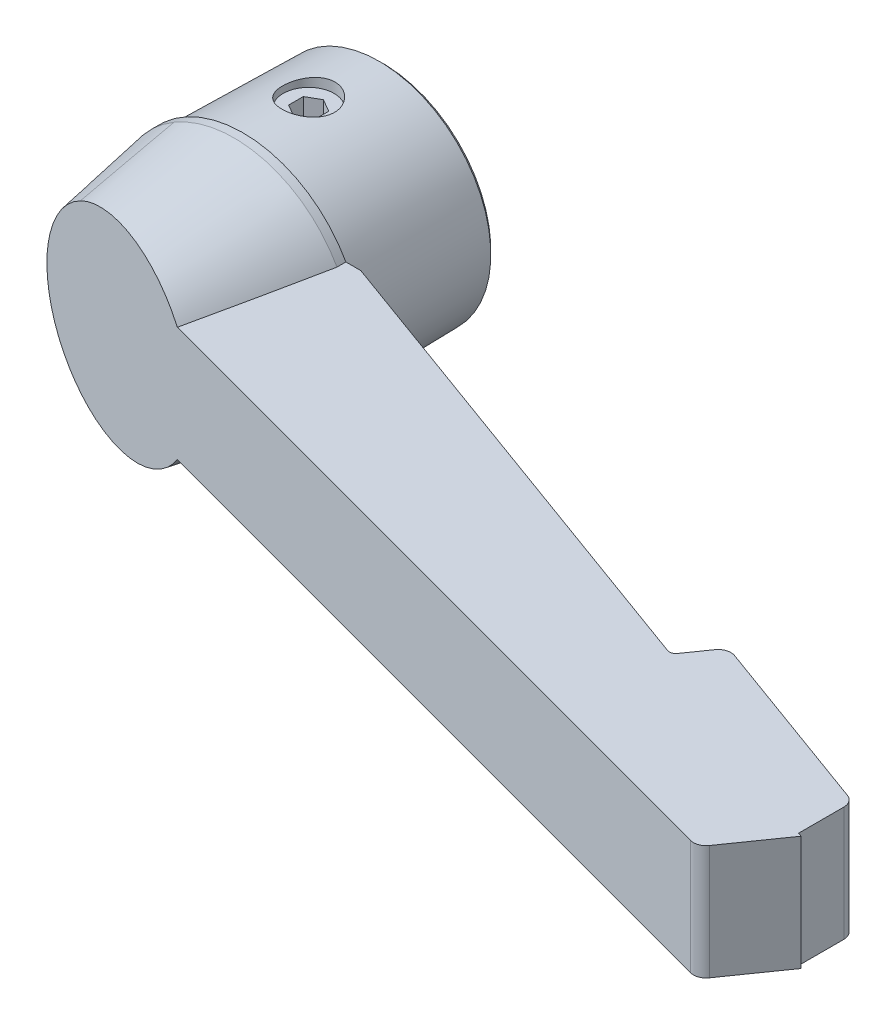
ISO-10303-21;
HEADER;
FILE_DESCRIPTION(('STEP AP214'),'2;1');
FILE_NAME('part.step','',(''),(''),'','','');
FILE_SCHEMA(('AUTOMOTIVE_DESIGN { 1 0 10303 214 1 1 1 1 }'));
ENDSEC;
DATA;
#1=APPLICATION_CONTEXT('core data for automotive mechanical design processes');
#2=APPLICATION_PROTOCOL_DEFINITION('international standard','automotive_design',2000,#1);
#3=PRODUCT_CONTEXT('',#1,'mechanical');
#4=PRODUCT('Part','Part','',(#3));
#5=PRODUCT_RELATED_PRODUCT_CATEGORY('part','',(#4));
#6=PRODUCT_DEFINITION_FORMATION('','',#4);
#7=PRODUCT_DEFINITION_CONTEXT('part definition',#1,'design');
#8=PRODUCT_DEFINITION('design','',#6,#7);
#9=PRODUCT_DEFINITION_SHAPE('','',#8);
#10=(LENGTH_UNIT() NAMED_UNIT(*) SI_UNIT(.MILLI.,.METRE.));
#11=(NAMED_UNIT(*) PLANE_ANGLE_UNIT() SI_UNIT($,.RADIAN.));
#12=(NAMED_UNIT(*) SI_UNIT($,.STERADIAN.) SOLID_ANGLE_UNIT());
#13=UNCERTAINTY_MEASURE_WITH_UNIT(LENGTH_MEASURE(1.E-05),#10,'distance_accuracy_value','');
#14=(GEOMETRIC_REPRESENTATION_CONTEXT(3) GLOBAL_UNCERTAINTY_ASSIGNED_CONTEXT((#13)) GLOBAL_UNIT_ASSIGNED_CONTEXT((#10,
#11,#12)) REPRESENTATION_CONTEXT('',''));
#15=CARTESIAN_POINT('',(0.,0.,0.));
#16=DIRECTION('',(0.,0.,1.));
#17=DIRECTION('',(1.,0.,0.));
#18=AXIS2_PLACEMENT_3D('',#15,#16,#17);
#19=CARTESIAN_POINT('',(-0.341550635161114,10.,5.5));
#20=DIRECTION('',(0.,-1.,0.));
#21=DIRECTION('',(1.,0.,0.));
#22=AXIS2_PLACEMENT_3D('',#19,#20,#21);
#23=CYLINDRICAL_SURFACE('',#22,2.);
#24=CARTESIAN_POINT('',(-0.341550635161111,3.75,5.5));
#25=DIRECTION('',(0.,-1.,0.));
#26=DIRECTION('',(0.,0.,-1.));
#27=AXIS2_PLACEMENT_3D('',#24,#25,#26);
#28=CIRCLE('',#27,2.);
#29=CARTESIAN_POINT('',(-0.341550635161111,3.75,3.5));
#30=VERTEX_POINT('',#29);
#31=EDGE_CURVE('E262',#30,#30,#28,.T.);
#32=ORIENTED_EDGE('',*,*,#31,.F.);
#33=EDGE_LOOP('',(#32));
#34=FACE_BOUND('',#33,.T.);
#35=CARTESIAN_POINT('',(-0.341550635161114,3.,5.5));
#36=DIRECTION('',(0.,-1.,0.));
#37=DIRECTION('',(1.,0.,0.));
#38=AXIS2_PLACEMENT_3D('',#35,#36,#37);
#39=CIRCLE('',#38,2.);
#40=CARTESIAN_POINT('',(1.65844936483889,3.,5.5));
#41=VERTEX_POINT('',#40);
#42=EDGE_CURVE('E20',#41,#41,#39,.T.);
#43=ORIENTED_EDGE('',*,*,#42,.T.);
#44=EDGE_LOOP('',(#43));
#45=FACE_BOUND('',#44,.T.);
#46=ADVANCED_FACE('F15',(#34,#45),#23,.F.);
#47=CARTESIAN_POINT('',(0.,0.,11.7000000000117));
#48=DIRECTION('',(0.,0.,-1.));
#49=DIRECTION('',(1.,0.,0.));
#50=AXIS2_PLACEMENT_3D('',#47,#48,#49);
#51=CONICAL_SURFACE('',#50,9.25,0.174532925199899);
#52=CARTESIAN_POINT('',(-0.364622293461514,0.,20.3802042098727));
#53=DIRECTION('',(-0.258755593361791,0.,0.96594282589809));
#54=DIRECTION('',(-0.96594282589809,0.,-0.258755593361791));
#55=AXIS2_PLACEMENT_3D('',#52,#53,#54);
#56=ELLIPSE('',#55,7.99161771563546,7.7108296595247);
#57=CARTESIAN_POINT('',(-4.48264390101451,-6.52201095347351,19.2770735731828));
#58=VERTEX_POINT('',#57);
#59=CARTESIAN_POINT('',(5.90391526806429,-4.5,22.0594124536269));
#60=VERTEX_POINT('',#59);
#61=EDGE_CURVE('E426',#58,#60,#56,.T.);
#62=ORIENTED_EDGE('',*,*,#61,.F.);
#63=CARTESIAN_POINT('',(4.39925873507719E-12,-12.5721062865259,-12.596004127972));
#64=DIRECTION('',(-3.38242236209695E-13,0.982457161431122,-0.186488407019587));
#65=DIRECTION('',(0.,-0.186488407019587,-0.982457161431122));
#66=AXIS2_PLACEMENT_3D('',#63,#64,#65);
#67=ELLIPSE('',#66,72.5730959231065,5.01122846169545);
#68=CARTESIAN_POINT('',(-4.71131235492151,-7.96027863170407,11.7000000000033));
#69=VERTEX_POINT('',#68);
#70=EDGE_CURVE('E413',#69,#58,#67,.T.);
#71=ORIENTED_EDGE('',*,*,#70,.F.);
#72=CARTESIAN_POINT('',(0.,0.,11.7000000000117));
#73=DIRECTION('',(0.,0.,1.));
#74=DIRECTION('',(-1.,0.,0.));
#75=AXIS2_PLACEMENT_3D('',#72,#73,#74);
#76=CIRCLE('',#75,9.25);
#77=CARTESIAN_POINT('',(8.08161493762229,-4.5,11.7000000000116));
#78=VERTEX_POINT('',#77);
#79=EDGE_CURVE('E387',#69,#78,#76,.T.);
#80=ORIENTED_EDGE('',*,*,#79,.T.);
#81=CARTESIAN_POINT('',(10.4043059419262,-4.5,-0.128964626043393));
#82=CARTESIAN_POINT('',(10.1699332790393,-4.5,1.09082103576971));
#83=CARTESIAN_POINT('',(9.93442349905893,-4.5,2.31038998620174));
#84=CARTESIAN_POINT('',(9.46042060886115,-4.5,4.7489472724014));
#85=CARTESIAN_POINT('',(9.2219274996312,-4.5,5.96793560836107));
#86=CARTESIAN_POINT('',(8.74077801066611,-4.5,8.40757188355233));
#87=CARTESIAN_POINT('',(8.49811439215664,-4.5,9.62821839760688));
#88=CARTESIAN_POINT('',(8.0080109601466,-4.5,12.0685608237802));
#89=CARTESIAN_POINT('',(7.76057111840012,-4.5,13.2882567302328));
#90=CARTESIAN_POINT('',(7.25943308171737,-4.5,15.7262432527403));
#91=CARTESIAN_POINT('',(7.00573550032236,-4.5,16.9445339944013));
#92=CARTESIAN_POINT('',(6.61870980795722,-4.5,18.7705884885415));
#93=CARTESIAN_POINT('',(6.48862223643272,-4.5,19.3790390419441));
#94=CARTESIAN_POINT('',(6.22585644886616,-4.5,20.5953800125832));
#95=CARTESIAN_POINT('',(6.09317823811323,-4.5,21.2032704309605));
#96=CARTESIAN_POINT('',(5.82488040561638,-4.5,22.4175270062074));
#97=CARTESIAN_POINT('',(5.68926507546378,-4.5,23.0238941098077));
#98=CARTESIAN_POINT('',(5.41420210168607,-4.5,24.2357570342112));
#99=CARTESIAN_POINT('',(5.27475447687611,-4.5,24.8412528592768));
#100=CARTESIAN_POINT('',(4.99103385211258,-4.5,26.0511884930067));
#101=CARTESIAN_POINT('',(4.84676031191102,-4.5,26.6556281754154));
#102=CARTESIAN_POINT('',(4.55200650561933,-4.5,27.8629896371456));
#103=CARTESIAN_POINT('',(4.40152630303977,-4.5,28.4659114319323));
#104=CARTESIAN_POINT('',(4.0920406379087,-4.5,29.6706773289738));
#105=CARTESIAN_POINT('',(3.93302110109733,-4.5,30.2725178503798));
#106=CARTESIAN_POINT('',(3.68575149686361,-4.5,31.1727627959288));
#107=CARTESIAN_POINT('',(3.6018874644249,-4.5,31.4723714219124));
#108=CARTESIAN_POINT('',(3.43057627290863,-4.5,32.0705844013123));
#109=CARTESIAN_POINT('',(3.34312891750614,-4.5,32.3691886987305));
#110=CARTESIAN_POINT('',(3.16365143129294,-4.5,32.9655573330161));
#111=CARTESIAN_POINT('',(3.07161398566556,-4.5,33.2633194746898));
#112=CARTESIAN_POINT('',(2.88188205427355,-4.5,33.8570035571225));
#113=CARTESIAN_POINT('',(2.78418841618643,-4.5,34.1529257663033));
#114=CARTESIAN_POINT('',(2.63194390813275,-4.5,34.5950349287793));
#115=CARTESIAN_POINT('',(2.58021357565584,-4.5,34.7421933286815));
#116=CARTESIAN_POINT('',(2.47452726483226,-4.5,35.0357030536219));
#117=CARTESIAN_POINT('',(2.4205713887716,-4.5,35.1820544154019));
#118=CARTESIAN_POINT('',(2.30999802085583,-4.5,35.4738370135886));
#119=CARTESIAN_POINT('',(2.25337922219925,-4.5,35.6192677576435));
#120=CARTESIAN_POINT('',(2.13689271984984,-4.5,35.908846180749));
#121=CARTESIAN_POINT('',(2.07702450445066,-4.5,36.05299365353));
#122=CARTESIAN_POINT('',(2.01523433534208,-4.5,36.1963316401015));
#123=B_SPLINE_CURVE_WITH_KNOTS('',3,(#81,#82,#83,#84,#85,#86,#87,#88,#89,#90,#91,#92,#93,#94,
#95,#96,#97,#98,#99,#100,#101,#102,#103,#104,#105,#106,#107,#108,#109,#110,#111,#112,#113,#114,
#115,#116,#117,#118,#119,#120,#121,#122),.UNSPECIFIED.,.F.,.F.,(4,2,2,2,2,2,2,2,2,2,2,2,2,2,2,2,
2,2,2,2,4),(0.,3.72629623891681,7.45259124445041,11.1861839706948,14.9197987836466,
18.6530489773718,20.5196494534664,22.3862461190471,24.2502782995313,26.1143013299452,
27.9785337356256,29.8427470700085,31.7101333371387,32.6434904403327,33.5768987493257,
34.5118452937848,35.4466520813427,35.914595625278,36.3825176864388,36.8506718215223,
37.3188998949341),.UNSPECIFIED.);
#124=EDGE_CURVE('E367',#78,#60,#123,.T.);
#125=ORIENTED_EDGE('',*,*,#124,.T.);
#126=EDGE_LOOP('',(#62,#71,#80,#125));
#127=FACE_BOUND('',#126,.T.);
#128=ADVANCED_FACE('F17',(#127),#51,.T.);
#129=CARTESIAN_POINT('',(-0.364622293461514,0.,20.3802042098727));
#130=DIRECTION('',(-0.258755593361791,0.,0.96594282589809));
#131=DIRECTION('',(-0.96594282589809,0.,-0.258755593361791));
#132=AXIS2_PLACEMENT_3D('',#129,#130,#131);
#133=ELLIPSE('',#132,7.99161771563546,7.7108296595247);
#134=CARTESIAN_POINT('',(5.90391526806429,4.5,22.0594124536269));
#135=VERTEX_POINT('',#134);
#136=CARTESIAN_POINT('',(-4.48264390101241,6.52201095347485,19.2770735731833));
#137=VERTEX_POINT('',#136);
#138=EDGE_CURVE('E429',#135,#137,#133,.T.);
#139=ORIENTED_EDGE('',*,*,#138,.F.);
#140=CARTESIAN_POINT('',(10.4043059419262,4.5,-0.128964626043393));
#141=CARTESIAN_POINT('',(10.1699332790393,4.5,1.09082103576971));
#142=CARTESIAN_POINT('',(9.93442349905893,4.5,2.31038998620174));
#143=CARTESIAN_POINT('',(9.46042060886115,4.5,4.7489472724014));
#144=CARTESIAN_POINT('',(9.2219274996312,4.5,5.96793560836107));
#145=CARTESIAN_POINT('',(8.74077801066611,4.5,8.40757188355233));
#146=CARTESIAN_POINT('',(8.49811439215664,4.5,9.62821839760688));
#147=CARTESIAN_POINT('',(8.0080109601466,4.5,12.0685608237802));
#148=CARTESIAN_POINT('',(7.76057111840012,4.5,13.2882567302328));
#149=CARTESIAN_POINT('',(7.25943308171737,4.5,15.7262432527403));
#150=CARTESIAN_POINT('',(7.00573550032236,4.5,16.9445339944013));
#151=CARTESIAN_POINT('',(6.61870980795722,4.5,18.7705884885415));
#152=CARTESIAN_POINT('',(6.48862223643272,4.5,19.3790390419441));
#153=CARTESIAN_POINT('',(6.22585644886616,4.5,20.5953800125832));
#154=CARTESIAN_POINT('',(6.09317823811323,4.5,21.2032704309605));
#155=CARTESIAN_POINT('',(5.82488040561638,4.5,22.4175270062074));
#156=CARTESIAN_POINT('',(5.68926507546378,4.5,23.0238941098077));
#157=CARTESIAN_POINT('',(5.41420210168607,4.5,24.2357570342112));
#158=CARTESIAN_POINT('',(5.27475447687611,4.5,24.8412528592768));
#159=CARTESIAN_POINT('',(4.99103385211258,4.5,26.0511884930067));
#160=CARTESIAN_POINT('',(4.84676031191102,4.5,26.6556281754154));
#161=CARTESIAN_POINT('',(4.55200650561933,4.5,27.8629896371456));
#162=CARTESIAN_POINT('',(4.40152630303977,4.5,28.4659114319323));
#163=CARTESIAN_POINT('',(4.0920406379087,4.5,29.6706773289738));
#164=CARTESIAN_POINT('',(3.93302110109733,4.5,30.2725178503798));
#165=CARTESIAN_POINT('',(3.68575149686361,4.5,31.1727627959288));
#166=CARTESIAN_POINT('',(3.6018874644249,4.5,31.4723714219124));
#167=CARTESIAN_POINT('',(3.43057627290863,4.5,32.0705844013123));
#168=CARTESIAN_POINT('',(3.34312891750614,4.5,32.3691886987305));
#169=CARTESIAN_POINT('',(3.16365143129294,4.5,32.9655573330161));
#170=CARTESIAN_POINT('',(3.07161398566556,4.5,33.2633194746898));
#171=CARTESIAN_POINT('',(2.88188205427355,4.5,33.8570035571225));
#172=CARTESIAN_POINT('',(2.78418841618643,4.5,34.1529257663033));
#173=CARTESIAN_POINT('',(2.63194390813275,4.5,34.5950349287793));
#174=CARTESIAN_POINT('',(2.58021357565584,4.5,34.7421933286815));
#175=CARTESIAN_POINT('',(2.47452726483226,4.5,35.0357030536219));
#176=CARTESIAN_POINT('',(2.4205713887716,4.5,35.1820544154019));
#177=CARTESIAN_POINT('',(2.30999802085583,4.5,35.4738370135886));
#178=CARTESIAN_POINT('',(2.25337922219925,4.5,35.6192677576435));
#179=CARTESIAN_POINT('',(2.13689271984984,4.5,35.908846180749));
#180=CARTESIAN_POINT('',(2.07702450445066,4.5,36.05299365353));
#181=CARTESIAN_POINT('',(2.01523433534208,4.5,36.1963316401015));
#182=B_SPLINE_CURVE_WITH_KNOTS('',3,(#140,#141,#142,#143,#144,#145,#146,#147,#148,#149,#150,
#151,#152,#153,#154,#155,#156,#157,#158,#159,#160,#161,#162,#163,#164,#165,#166,#167,#168,#169,
#170,#171,#172,#173,#174,#175,#176,#177,#178,#179,#180,#181),.UNSPECIFIED.,.F.,.F.,(4,2,2,2,2,2,
2,2,2,2,2,2,2,2,2,2,2,2,2,2,4),(0.,3.72629623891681,7.45259124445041,11.1861839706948,
14.9197987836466,18.6530489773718,20.5196494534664,22.3862461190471,24.2502782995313,
26.1143013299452,27.9785337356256,29.8427470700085,31.7101333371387,32.6434904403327,
33.5768987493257,34.5118452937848,35.4466520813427,35.914595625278,36.3825176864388,
36.8506718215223,37.3188998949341),.UNSPECIFIED.);
#183=CARTESIAN_POINT('',(8.08161493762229,4.5,11.7000000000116));
#184=VERTEX_POINT('',#183);
#185=EDGE_CURVE('E355',#184,#135,#182,.T.);
#186=ORIENTED_EDGE('',*,*,#185,.F.);
#187=CARTESIAN_POINT('',(-4.71131235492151,7.96027863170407,11.7000000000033));
#188=VERTEX_POINT('',#187);
#189=EDGE_CURVE('E388',#184,#188,#76,.T.);
#190=ORIENTED_EDGE('',*,*,#189,.T.);
#191=CARTESIAN_POINT('',(4.39925873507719E-12,12.5721062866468,-12.5960041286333));
#192=DIRECTION('',(-3.42200032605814E-13,-0.982457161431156,-0.186488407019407));
#193=DIRECTION('',(0.,0.186488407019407,-0.982457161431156));
#194=AXIS2_PLACEMENT_3D('',#191,#192,#193);
#195=ELLIPSE('',#194,72.5730959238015,5.01122846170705);
#196=EDGE_CURVE('E436',#137,#188,#195,.T.);
#197=ORIENTED_EDGE('',*,*,#196,.F.);
#198=EDGE_LOOP('',(#139,#186,#190,#197));
#199=FACE_BOUND('',#198,.T.);
#200=ADVANCED_FACE('F569',(#199),#51,.T.);
#201=CARTESIAN_POINT('',(-10.9251634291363,-6.94018717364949,17.0740399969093));
#202=DIRECTION('',(-3.38242236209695E-13,0.982457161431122,-0.186488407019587));
#203=DIRECTION('',(0.,0.186488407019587,0.982457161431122));
#204=AXIS2_PLACEMENT_3D('',#201,#202,#203);
#205=PLANE('',#204);
#206=ORIENTED_EDGE('',*,*,#70,.T.);
#207=DIRECTION('',(0.964779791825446,0.0490574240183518,0.25844404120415));
#208=VECTOR('',#207,1.);
#209=CARTESIAN_POINT('',(-11.0484413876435,-6.85587067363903,17.518235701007));
#210=LINE('',#209,#208);
#211=CARTESIAN_POINT('',(-4.46644041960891,-6.5211870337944,19.2814141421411));
#212=VERTEX_POINT('',#211);
#213=EDGE_CURVE('E428',#58,#212,#210,.T.);
#214=ORIENTED_EDGE('',*,*,#213,.T.);
#215=DIRECTION('',(-0.0317163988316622,-0.186394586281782,-0.981962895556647));
#216=VECTOR('',#215,1.);
#217=CARTESIAN_POINT('',(-4.53773635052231,-6.94018717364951,17.0740399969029));
#218=LINE('',#217,#216);
#219=EDGE_CURVE('E434',#212,#69,#218,.T.);
#220=ORIENTED_EDGE('',*,*,#219,.T.);
#221=EDGE_LOOP('',(#206,#214,#220));
#222=FACE_BOUND('',#221,.T.);
#223=ADVANCED_FACE('F340',(#222),#205,.T.);
#224=CARTESIAN_POINT('',(-4.53773635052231,6.94018717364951,17.074039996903));
#225=DIRECTION('',(-3.42200032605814E-13,-0.982457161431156,-0.186488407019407));
#226=DIRECTION('',(0.,0.186488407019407,-0.982457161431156));
#227=AXIS2_PLACEMENT_3D('',#224,#225,#226);
#228=PLANE('',#227);
#229=DIRECTION('',(0.0317163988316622,-0.186394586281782,0.981962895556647));
#230=VECTOR('',#229,1.);
#231=CARTESIAN_POINT('',(-4.53773635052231,6.94018717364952,17.0740399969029));
#232=LINE('',#231,#230);
#233=CARTESIAN_POINT('',(-4.46644041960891,6.5211870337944,19.2814141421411));
#234=VERTEX_POINT('',#233);
#235=EDGE_CURVE('E404',#188,#234,#232,.T.);
#236=ORIENTED_EDGE('',*,*,#235,.T.);
#237=DIRECTION('',(-0.964779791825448,0.0490574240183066,-0.25844404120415));
#238=VECTOR('',#237,1.);
#239=CARTESIAN_POINT('',(-5.10302396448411,6.55355623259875,19.1108869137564));
#240=LINE('',#239,#238);
#241=EDGE_CURVE('E39',#234,#137,#240,.T.);
#242=ORIENTED_EDGE('',*,*,#241,.T.);
#243=ORIENTED_EDGE('',*,*,#196,.T.);
#244=EDGE_LOOP('',(#236,#242,#243));
#245=FACE_BOUND('',#244,.T.);
#246=ADVANCED_FACE('F311',(#245),#228,.T.);
#247=CARTESIAN_POINT('',(-7.35482350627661,0.,22.4480799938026));
#248=CARTESIAN_POINT('',(-7.56539867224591,0.,21.2538488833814));
#249=CARTESIAN_POINT('',(-7.98654900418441,0.,18.8653866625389));
#250=CARTESIAN_POINT('',(-8.61827450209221,0.,15.2826933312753));
#251=CARTESIAN_POINT('',(-9.03942483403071,0.,12.8942311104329));
#252=CARTESIAN_POINT('',(-9.25,0.,11.7000000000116));
#253=CARTESIAN_POINT('',(-7.35482350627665,-0.00230316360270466,22.4480799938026));
#254=CARTESIAN_POINT('',(-7.56539867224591,-0.00240199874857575,21.2538488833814));
#255=CARTESIAN_POINT('',(-7.98654900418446,-0.00259888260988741,18.8653866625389));
#256=CARTESIAN_POINT('',(-8.61827450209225,-0.00289182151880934,15.2826933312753));
#257=CARTESIAN_POINT('',(-9.03942483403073,-0.00308552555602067,12.8942311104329));
#258=CARTESIAN_POINT('',(-9.25000000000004,-0.00318198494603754,11.7000000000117));
#259=CARTESIAN_POINT('',(-7.35481809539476,-0.0138228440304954,22.4480799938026));
#260=CARTESIAN_POINT('',(-7.56538829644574,-0.0144160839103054,21.2538752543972));
#261=CARTESIAN_POINT('',(-7.98653335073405,-0.0155978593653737,18.8654394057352));
#262=CARTESIAN_POINT('',(-8.61825791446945,-0.0173563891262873,15.2827460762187));
#263=CARTESIAN_POINT('',(-9.03941227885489,-0.0185193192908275,12.894257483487));
#264=CARTESIAN_POINT('',(-9.249991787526,-0.0190984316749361,11.7000000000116));
#265=CARTESIAN_POINT('',(-7.35455758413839,-0.106237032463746,22.4480799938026));
#266=CARTESIAN_POINT('',(-7.56508165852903,-0.110802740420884,21.2540507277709));
#267=CARTESIAN_POINT('',(-7.98616550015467,-0.11990002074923,18.8657904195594));
#268=CARTESIAN_POINT('',(-8.61784499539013,-0.133442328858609,15.2830971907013));
#269=CARTESIAN_POINT('',(-9.03900050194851,-0.142401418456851,12.8944330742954));
#270=CARTESIAN_POINT('',(-9.24959612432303,-0.146863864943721,11.7000000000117));
#271=CARTESIAN_POINT('',(-7.34794689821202,-0.418334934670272,22.4480799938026));
#272=CARTESIAN_POINT('',(-7.55798323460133,-0.436369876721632,21.2546218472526));
#273=CARTESIAN_POINT('',(-7.97819436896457,-0.472331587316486,18.8669335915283));
#274=CARTESIAN_POINT('',(-8.60872294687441,-0.525931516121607,15.2842417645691));
#275=CARTESIAN_POINT('',(-9.02921690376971,-0.561435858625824,12.8950058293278));
#276=CARTESIAN_POINT('',(-9.23953345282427,-0.579133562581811,11.7000000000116));
#277=CARTESIAN_POINT('',(-7.15288002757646,-2.76615372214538,22.4480799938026));
#278=CARTESIAN_POINT('',(-7.35051122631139,-2.88863417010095,21.258375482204));
#279=CARTESIAN_POINT('',(-7.74651182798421,-3.13406286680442,18.874474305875));
#280=CARTESIAN_POINT('',(-8.34161625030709,-3.50292104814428,15.2918331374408));
#281=CARTESIAN_POINT('',(-8.73909810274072,-3.74930966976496,12.8988185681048));
#282=CARTESIAN_POINT('',(-8.93821879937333,-3.87274470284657,11.7000000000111));
#283=CARTESIAN_POINT('',(-5.99379441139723,-4.71876642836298,22.4480799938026));
#284=CARTESIAN_POINT('',(-6.12244526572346,-4.91760514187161,21.2577205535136));
#285=CARTESIAN_POINT('',(-6.3800547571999,-5.31595909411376,18.8731551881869));
#286=CARTESIAN_POINT('',(-6.76676990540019,-5.91456299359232,15.2904999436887));
#287=CARTESIAN_POINT('',(-7.02478291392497,-6.31435578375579,12.8981472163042));
#288=CARTESIAN_POINT('',(-7.15394657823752,-6.51459898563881,11.7000000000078));
#289=CARTESIAN_POINT('',(-4.36416034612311,-5.92009571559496,22.4480799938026));
#290=CARTESIAN_POINT('',(-4.40273279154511,-6.14678270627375,21.2538488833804));
#291=CARTESIAN_POINT('',(-4.47987768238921,-6.60015668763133,18.8653866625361));
#292=CARTESIAN_POINT('',(-4.59559501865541,-7.2802176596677,15.2826933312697));
#293=CARTESIAN_POINT('',(-4.67273990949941,-7.73359164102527,12.8942311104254));
#294=CARTESIAN_POINT('',(-4.71131235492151,-7.96027863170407,11.7000000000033));
#295=(BOUNDED_SURFACE() B_SPLINE_SURFACE(3,3,((#247,#248,#249,#250,#251,#252),(#253,#254,#255,
#256,#257,#258),(#259,#260,#261,#262,#263,#264),(#265,#266,#267,#268,#269,#270),(#271,#272,#273,
#274,#275,#276),(#277,#278,#279,#280,#281,#282),(#283,#284,#285,#286,#287,#288),(#289,#290,#291,
#292,#293,#294)),.UNSPECIFIED.,.F.,.F.,.F.) B_SPLINE_SURFACE_WITH_KNOTS((4,1,1,1,1,4),(4,1,1,4),
(0.,0.00104166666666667,0.00520833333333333,0.0416666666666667,0.140625,1.),(0.,
0.333333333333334,0.666666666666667,1.),
.UNSPECIFIED.) GEOMETRIC_REPRESENTATION_ITEM() RATIONAL_B_SPLINE_SURFACE(((1.,1.,1.,1.,1.,1.),
(0.999925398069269,0.999923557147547,0.999919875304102,0.999914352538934,0.999910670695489,
0.999908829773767),(0.999552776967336,0.999541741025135,0.999519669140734,0.999486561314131,
0.99946448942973,0.999453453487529),(0.996587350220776,0.996503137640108,0.996334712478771,
0.996082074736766,0.99591364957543,0.995829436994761),(0.987059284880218,0.986739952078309,
0.986101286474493,0.985143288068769,0.984504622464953,0.984185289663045),(0.928801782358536,
0.927044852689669,0.923530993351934,0.918260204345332,0.914746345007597,0.91298941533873),
(0.938453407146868,0.936934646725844,0.933897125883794,0.929340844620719,0.92630332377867,
0.924784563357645),(1.,1.,1.,1.,1.,1.))) REPRESENTATION_ITEM('') SURFACE());
#296=CARTESIAN_POINT('',(-8.08406809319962,0.,18.3123284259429));
#297=CARTESIAN_POINT('',(-8.08409527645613,-0.210863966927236,18.3123211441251));
#298=CARTESIAN_POINT('',(-8.07539696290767,-0.421722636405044,18.3146512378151));
#299=CARTESIAN_POINT('',(-8.04073919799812,-0.841890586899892,18.3239353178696));
#300=CARTESIAN_POINT('',(-8.01478173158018,-1.05120004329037,18.3308887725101));
#301=CARTESIAN_POINT('',(-7.9459081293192,-1.46610109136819,18.3493385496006));
#302=CARTESIAN_POINT('',(-7.90304767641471,-1.67170259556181,18.3608199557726));
#303=CARTESIAN_POINT('',(-7.80073715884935,-2.07843093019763,18.3882267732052));
#304=CARTESIAN_POINT('',(-7.74128709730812,-2.27955776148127,18.4041521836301));
#305=CARTESIAN_POINT('',(-7.60627697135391,-2.67598106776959,18.4403185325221));
#306=CARTESIAN_POINT('',(-7.53071311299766,-2.8712761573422,18.4605604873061));
#307=CARTESIAN_POINT('',(-7.36407157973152,-3.2547382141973,18.5052002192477));
#308=CARTESIAN_POINT('',(-7.27298709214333,-3.44290200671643,18.5295998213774));
#309=CARTESIAN_POINT('',(-7.07596401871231,-3.81094570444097,18.5823781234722));
#310=CARTESIAN_POINT('',(-6.97001066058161,-3.99081713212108,18.61076078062));
#311=CARTESIAN_POINT('',(-6.74420548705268,-4.34084131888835,18.6712491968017));
#312=CARTESIAN_POINT('',(-6.62435902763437,-4.51099778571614,18.7033535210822));
#313=CARTESIAN_POINT('',(-6.35730509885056,-4.85931911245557,18.7748916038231));
#314=CARTESIAN_POINT('',(-6.20853606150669,-5.03620361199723,18.8147436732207));
#315=CARTESIAN_POINT('',(-5.89620706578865,-5.37542022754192,18.898409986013));
#316=CARTESIAN_POINT('',(-5.73264429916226,-5.5377495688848,18.942224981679));
#317=CARTESIAN_POINT('',(-5.39205281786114,-5.84679974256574,19.0334622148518));
#318=CARTESIAN_POINT('',(-5.21501258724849,-5.99350696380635,19.0808875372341));
#319=CARTESIAN_POINT('',(-4.84917160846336,-6.27015033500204,19.1788885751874));
#320=CARTESIAN_POINT('',(-4.66037402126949,-6.40009096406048,19.2294634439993));
#321=CARTESIAN_POINT('',(-4.46644041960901,-6.5211870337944,19.2814141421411));
#322=B_SPLINE_CURVE_WITH_KNOTS('',3,(#296,#297,#298,#299,#300,#301,#302,#303,#304,#305,#306,
#307,#308,#309,#310,#311,#312,#313,#314,#315,#316,#317,#318,#319,#320,#321),.UNSPECIFIED.,.F.,
.F.,(4,2,2,2,2,2,2,2,2,2,2,2,4),(0.,0.632391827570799,1.26471093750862,1.89496419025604,
2.52521732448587,3.15561901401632,3.78629813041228,4.41760832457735,5.04867594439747,
5.75131436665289,6.45408644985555,7.15746591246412,7.86065708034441),.UNSPECIFIED.);
#323=CARTESIAN_POINT('',(-8.08406809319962,0.,18.3123284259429));
#324=VERTEX_POINT('',#323);
#325=EDGE_CURVE('E320',#324,#212,#322,.T.);
#326=DIRECTION('',(0.173648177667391,0.,0.984807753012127));
#327=VECTOR('',#326,1.);
#328=CARTESIAN_POINT('',(-8.30241175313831,0.,17.0740399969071));
#329=LINE('',#328,#327);
#330=CARTESIAN_POINT('',(-9.25,0.,11.7000000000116));
#331=VERTEX_POINT('',#330);
#332=EDGE_CURVE('E402',#331,#324,#329,.T.);
#333=EDGE_CURVE('E25',#331,#69,#76,.T.);
#334=ORIENTED_EDGE('',*,*,#325,.F.);
#335=ORIENTED_EDGE('',*,*,#332,.F.);
#336=ORIENTED_EDGE('',*,*,#333,.T.);
#337=ORIENTED_EDGE('',*,*,#219,.F.);
#338=EDGE_LOOP('',(#334,#335,#336,#337));
#339=FACE_BOUND('',#338,.T.);
#340=ADVANCED_FACE('F331',(#339),#295,.F.);
#341=CARTESIAN_POINT('',(-4.36416034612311,5.92009571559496,22.4480799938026));
#342=CARTESIAN_POINT('',(-4.40273279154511,6.14678270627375,21.2538488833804));
#343=CARTESIAN_POINT('',(-4.47987768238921,6.60015668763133,18.8653866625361));
#344=CARTESIAN_POINT('',(-4.59559501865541,7.2802176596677,15.2826933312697));
#345=CARTESIAN_POINT('',(-4.67273990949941,7.73359164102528,12.8942311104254));
#346=CARTESIAN_POINT('',(-4.71131235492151,7.96027863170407,11.7000000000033));
#347=CARTESIAN_POINT('',(-5.99379441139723,4.71876642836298,22.4480799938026));
#348=CARTESIAN_POINT('',(-6.12244526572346,4.91760514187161,21.2577205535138));
#349=CARTESIAN_POINT('',(-6.3800547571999,5.31595909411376,18.8731551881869));
#350=CARTESIAN_POINT('',(-6.76676990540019,5.91456299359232,15.2904999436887));
#351=CARTESIAN_POINT('',(-7.02478291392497,6.3143557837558,12.8981472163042));
#352=CARTESIAN_POINT('',(-7.15394657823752,6.51459898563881,11.7000000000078));
#353=CARTESIAN_POINT('',(-7.15288002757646,2.76615372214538,22.4480799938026));
#354=CARTESIAN_POINT('',(-7.35051122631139,2.88863417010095,21.258375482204));
#355=CARTESIAN_POINT('',(-7.74651182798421,3.13406286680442,18.874474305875));
#356=CARTESIAN_POINT('',(-8.34161625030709,3.50292104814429,15.2918331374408));
#357=CARTESIAN_POINT('',(-8.73909810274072,3.74930966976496,12.8988185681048));
#358=CARTESIAN_POINT('',(-8.93821879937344,3.87274470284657,11.7000000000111));
#359=CARTESIAN_POINT('',(-7.34794689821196,0.418334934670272,22.4480799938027));
#360=CARTESIAN_POINT('',(-7.55798323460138,0.436369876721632,21.2546218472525));
#361=CARTESIAN_POINT('',(-7.97819436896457,0.472331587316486,18.8669335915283));
#362=CARTESIAN_POINT('',(-8.60872294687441,0.525931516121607,15.2842417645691));
#363=CARTESIAN_POINT('',(-9.02921690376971,0.561435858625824,12.8950058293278));
#364=CARTESIAN_POINT('',(-9.23953345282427,0.579133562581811,11.7000000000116));
#365=CARTESIAN_POINT('',(-7.35455758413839,0.106237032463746,22.4480799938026));
#366=CARTESIAN_POINT('',(-7.56508165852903,0.110802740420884,21.2540507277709));
#367=CARTESIAN_POINT('',(-7.98616550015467,0.119900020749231,18.8657904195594));
#368=CARTESIAN_POINT('',(-8.61784499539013,0.133442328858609,15.2830971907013));
#369=CARTESIAN_POINT('',(-9.03900050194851,0.142401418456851,12.8944330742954));
#370=CARTESIAN_POINT('',(-9.24959612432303,0.146863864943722,11.7000000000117));
#371=CARTESIAN_POINT('',(-7.35481809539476,0.0138228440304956,22.4480799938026));
#372=CARTESIAN_POINT('',(-7.56538829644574,0.0144160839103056,21.2538752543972));
#373=CARTESIAN_POINT('',(-7.98653335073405,0.015597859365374,18.8654394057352));
#374=CARTESIAN_POINT('',(-8.61825791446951,0.0173563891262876,15.2827460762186));
#375=CARTESIAN_POINT('',(-9.03941227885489,0.0185193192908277,12.894257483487));
#376=CARTESIAN_POINT('',(-9.249991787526,0.0190984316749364,11.7000000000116));
#377=CARTESIAN_POINT('',(-7.35482350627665,0.00230316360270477,22.4480799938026));
#378=CARTESIAN_POINT('',(-7.56539867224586,0.0024019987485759,21.2538488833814));
#379=CARTESIAN_POINT('',(-7.98654900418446,0.00259888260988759,18.8653866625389));
#380=CARTESIAN_POINT('',(-8.61827450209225,0.00289182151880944,15.2826933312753));
#381=CARTESIAN_POINT('',(-9.03942483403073,0.00308552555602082,12.8942311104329));
#382=CARTESIAN_POINT('',(-9.25000000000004,0.00318198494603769,11.7000000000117));
#383=CARTESIAN_POINT('',(-7.35482350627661,0.,22.4480799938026));
#384=CARTESIAN_POINT('',(-7.56539867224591,0.,21.2538488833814));
#385=CARTESIAN_POINT('',(-7.98654900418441,0.,18.8653866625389));
#386=CARTESIAN_POINT('',(-8.61827450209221,0.,15.2826933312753));
#387=CARTESIAN_POINT('',(-9.03942483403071,0.,12.8942311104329));
#388=CARTESIAN_POINT('',(-9.25,0.,11.7000000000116));
#389=(BOUNDED_SURFACE() B_SPLINE_SURFACE(3,3,((#341,#342,#343,#344,#345,#346),(#347,#348,#349,
#350,#351,#352),(#353,#354,#355,#356,#357,#358),(#359,#360,#361,#362,#363,#364),(#365,#366,#367,
#368,#369,#370),(#371,#372,#373,#374,#375,#376),(#377,#378,#379,#380,#381,#382),(#383,#384,#385,
#386,#387,#388)),.UNSPECIFIED.,.F.,.F.,.F.) B_SPLINE_SURFACE_WITH_KNOTS((4,1,1,1,1,4),(4,1,1,4),
(0.,0.859375,0.958333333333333,0.994791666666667,0.998958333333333,1.),(0.,0.333333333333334,
0.666666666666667,1.),
.UNSPECIFIED.) GEOMETRIC_REPRESENTATION_ITEM() RATIONAL_B_SPLINE_SURFACE(((1.,1.,1.,1.,1.,1.),
(0.938453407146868,0.936934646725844,0.933897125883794,0.929340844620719,0.92630332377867,
0.924784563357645),(0.928801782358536,0.927044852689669,0.923530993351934,0.918260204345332,
0.914746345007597,0.91298941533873),(0.987059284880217,0.98673995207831,0.986101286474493,
0.985143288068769,0.984504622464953,0.984185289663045),(0.996587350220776,0.996503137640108,
0.996334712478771,0.996082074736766,0.99591364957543,0.995829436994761),(0.999552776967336,
0.999541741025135,0.999519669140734,0.999486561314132,0.99946448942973,0.999453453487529),
(0.999925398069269,0.999923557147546,0.999919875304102,0.999914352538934,0.999910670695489,
0.999908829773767),(1.,1.,1.,1.,1.,1.))) REPRESENTATION_ITEM('') SURFACE());
#390=CARTESIAN_POINT('',(-4.46644041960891,6.5211870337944,19.2814141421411));
#391=CARTESIAN_POINT('',(-4.64826042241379,6.40764911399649,19.2327084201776));
#392=CARTESIAN_POINT('',(-4.8255671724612,6.28634362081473,19.1852117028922));
#393=CARTESIAN_POINT('',(-5.16991392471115,6.02896235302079,19.0929685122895));
#394=CARTESIAN_POINT('',(-5.33695250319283,5.89288453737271,19.0482224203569));
#395=CARTESIAN_POINT('',(-5.65947847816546,5.60674929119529,18.9618245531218));
#396=CARTESIAN_POINT('',(-5.81496538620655,5.45669127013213,18.9201729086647));
#397=CARTESIAN_POINT('',(-6.11316121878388,5.14354757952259,18.8402925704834));
#398=CARTESIAN_POINT('',(-6.25587094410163,4.98046272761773,18.8020636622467));
#399=CARTESIAN_POINT('',(-6.5275944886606,4.6420341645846,18.7292746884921));
#400=CARTESIAN_POINT('',(-6.65658558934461,4.4666708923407,18.6947207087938));
#401=CARTESIAN_POINT('',(-6.89958384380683,4.10502396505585,18.6296266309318));
#402=CARTESIAN_POINT('',(-7.01358404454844,3.91873530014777,18.5990883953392));
#403=CARTESIAN_POINT('',(-7.22545615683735,3.53678537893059,18.5423323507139));
#404=CARTESIAN_POINT('',(-7.32334197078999,3.34113239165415,18.5161108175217));
#405=CARTESIAN_POINT('',(-7.50219652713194,2.94182064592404,18.4681994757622));
#406=CARTESIAN_POINT('',(-7.58317369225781,2.73816593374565,18.4465074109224));
#407=CARTESIAN_POINT('',(-7.72585513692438,2.32911292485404,18.4082860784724));
#408=CARTESIAN_POINT('',(-7.78796505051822,2.12386620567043,18.3916481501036));
#409=CARTESIAN_POINT('',(-7.89486870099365,1.70859512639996,18.3630109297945));
#410=CARTESIAN_POINT('',(-7.93966273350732,1.49857084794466,18.3510115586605));
#411=CARTESIAN_POINT('',(-8.01164412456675,1.07462839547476,18.3317292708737));
#412=CARTESIAN_POINT('',(-8.0387754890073,0.860700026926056,18.3244613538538));
#413=CARTESIAN_POINT('',(-8.07500357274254,0.431183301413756,18.3147566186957));
#414=CARTESIAN_POINT('',(-8.08409773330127,0.215594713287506,18.3123204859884));
#415=CARTESIAN_POINT('',(-8.08406809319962,0.,18.3123284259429));
#416=B_SPLINE_CURVE_WITH_KNOTS('',3,(#390,#391,#392,#393,#394,#395,#396,#397,#398,#399,#400,
#401,#402,#403,#404,#405,#406,#407,#408,#409,#410,#411,#412,#413,#414,#415),.UNSPECIFIED.,.F.,
.F.,(4,2,2,2,2,2,2,2,2,2,2,2,4),(0.,0.659297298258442,1.3186858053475,1.97810217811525,
2.63747719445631,3.29792769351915,3.95868344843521,4.61886612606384,5.2787191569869,
5.9231747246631,6.56761928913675,7.21409704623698,7.86066650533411),.UNSPECIFIED.);
#417=EDGE_CURVE('E9',#234,#324,#416,.T.);
#418=EDGE_CURVE('E385',#188,#331,#76,.T.);
#419=ORIENTED_EDGE('',*,*,#417,.F.);
#420=ORIENTED_EDGE('',*,*,#235,.F.);
#421=ORIENTED_EDGE('',*,*,#418,.T.);
#422=ORIENTED_EDGE('',*,*,#332,.T.);
#423=EDGE_LOOP('',(#419,#420,#421,#422));
#424=FACE_BOUND('',#423,.T.);
#425=ADVANCED_FACE('F338',(#424),#389,.F.);
#426=CARTESIAN_POINT('',(0.,0.,27.8142423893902));
#427=DIRECTION('',(0.,0.,1.));
#428=DIRECTION('',(-1.,0.,0.));
#429=AXIS2_PLACEMENT_3D('',#426,#427,#428);
#430=CYLINDRICAL_SURFACE('',#429,9.25);
#431=DIRECTION('',(0.,0.,1.));
#432=VECTOR('',#431,1.);
#433=CARTESIAN_POINT('',(8.08161493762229,-4.5,27.8142423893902));
#434=LINE('',#433,#432);
#435=CARTESIAN_POINT('',(8.08161493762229,-4.5,11.));
#436=VERTEX_POINT('',#435);
#437=EDGE_CURVE('E363',#78,#436,#434,.F.);
#438=ORIENTED_EDGE('',*,*,#437,.F.);
#439=ORIENTED_EDGE('',*,*,#79,.F.);
#440=ORIENTED_EDGE('',*,*,#333,.F.);
#441=ORIENTED_EDGE('',*,*,#418,.F.);
#442=ORIENTED_EDGE('',*,*,#189,.F.);
#443=DIRECTION('',(0.,0.,1.));
#444=VECTOR('',#443,1.);
#445=CARTESIAN_POINT('',(8.08161493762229,4.5,27.8142423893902));
#446=LINE('',#445,#444);
#447=CARTESIAN_POINT('',(8.08161493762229,4.5,11.));
#448=VERTEX_POINT('',#447);
#449=EDGE_CURVE('E364',#184,#448,#446,.F.);
#450=ORIENTED_EDGE('',*,*,#449,.T.);
#451=CARTESIAN_POINT('',(0.,0.,11.));
#452=DIRECTION('',(0.,0.,1.));
#453=DIRECTION('',(-1.,0.,0.));
#454=AXIS2_PLACEMENT_3D('',#451,#452,#453);
#455=CIRCLE('',#454,9.25);
#456=EDGE_CURVE('E383',#448,#436,#455,.T.);
#457=ORIENTED_EDGE('',*,*,#456,.T.);
#458=EDGE_LOOP('',(#438,#439,#440,#441,#442,#450,#457));
#459=FACE_BOUND('',#458,.T.);
#460=ADVANCED_FACE('F408',(#459),#430,.T.);
#461=CARTESIAN_POINT('',(-8.95000000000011,0.,11.));
#462=DIRECTION('',(0.,0.,1.));
#463=DIRECTION('',(-1.,0.,0.));
#464=AXIS2_PLACEMENT_3D('',#461,#462,#463);
#465=PLANE('',#464);
#466=DIRECTION('',(-1.,0.,0.));
#467=VECTOR('',#466,1.);
#468=CARTESIAN_POINT('',(9.25,4.5,11.));
#469=LINE('',#468,#467);
#470=CARTESIAN_POINT('',(9.25,4.5,11.));
#471=VERTEX_POINT('',#470);
#472=EDGE_CURVE('E440',#471,#448,#469,.T.);
#473=ORIENTED_EDGE('',*,*,#472,.F.);
#474=DIRECTION('',(0.,1.,0.));
#475=VECTOR('',#474,1.);
#476=CARTESIAN_POINT('',(9.25,-4.5,11.));
#477=LINE('',#476,#475);
#478=CARTESIAN_POINT('',(9.25,-4.5,11.));
#479=VERTEX_POINT('',#478);
#480=EDGE_CURVE('E522',#479,#471,#477,.T.);
#481=ORIENTED_EDGE('',*,*,#480,.F.);
#482=DIRECTION('',(-1.,0.,0.));
#483=VECTOR('',#482,1.);
#484=CARTESIAN_POINT('',(9.25,-4.5,11.));
#485=LINE('',#484,#483);
#486=EDGE_CURVE('E474',#479,#436,#485,.T.);
#487=ORIENTED_EDGE('',*,*,#486,.T.);
#488=ORIENTED_EDGE('',*,*,#456,.F.);
#489=EDGE_LOOP('',(#473,#481,#487,#488));
#490=FACE_BOUND('',#489,.T.);
#491=CARTESIAN_POINT('',(0.,0.,11.));
#492=DIRECTION('',(0.,0.,1.));
#493=DIRECTION('',(-1.,0.,0.));
#494=AXIS2_PLACEMENT_3D('',#491,#492,#493);
#495=CIRCLE('',#494,8.95);
#496=CARTESIAN_POINT('',(-8.95,0.,11.));
#497=VERTEX_POINT('',#496);
#498=EDGE_CURVE('E380',#497,#497,#495,.T.);
#499=ORIENTED_EDGE('',*,*,#498,.T.);
#500=EDGE_LOOP('',(#499));
#501=FACE_BOUND('',#500,.T.);
#502=ADVANCED_FACE('F529',(#490,#501),#465,.F.);
#503=CARTESIAN_POINT('',(0.,0.,11.));
#504=DIRECTION('',(0.,0.,1.));
#505=DIRECTION('',(-1.,0.,0.));
#506=AXIS2_PLACEMENT_3D('',#503,#504,#505);
#507=CONICAL_SURFACE('',#506,8.95,0.0174532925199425);
#508=CARTESIAN_POINT('',(-1.7733070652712,8.64971715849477,4.1035496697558));
#509=CARTESIAN_POINT('',(-1.85092205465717,8.63522326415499,4.18313071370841));
#510=CARTESIAN_POINT('',(-1.92195367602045,8.62111239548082,4.26925739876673));
#511=CARTESIAN_POINT('',(-2.04886829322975,8.59512310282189,4.45238955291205));
#512=CARTESIAN_POINT('',(-2.10474370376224,8.58324579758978,4.5494004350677));
#513=CARTESIAN_POINT('',(-2.19969986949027,8.56305221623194,4.75181178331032));
#514=CARTESIAN_POINT('',(-2.23876316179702,8.55473964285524,4.85722083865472));
#515=CARTESIAN_POINT('',(-2.29871997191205,8.54273181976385,5.07332114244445));
#516=CARTESIAN_POINT('',(-2.31961876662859,8.53903522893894,5.18401084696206));
#517=CARTESIAN_POINT('',(-2.34230241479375,8.53683870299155,5.40489518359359));
#518=CARTESIAN_POINT('',(-2.34450104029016,8.53822529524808,5.51504631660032));
#519=CARTESIAN_POINT('',(-2.33083705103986,8.54592753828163,5.73404235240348));
#520=CARTESIAN_POINT('',(-2.31497473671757,8.55224310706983,5.84288727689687));
#521=CARTESIAN_POINT('',(-2.26600388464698,8.56917993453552,6.05519573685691));
#522=CARTESIAN_POINT('',(-2.23305521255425,8.57976108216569,6.15869954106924));
#523=CARTESIAN_POINT('',(-2.15106254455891,8.60428117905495,6.35869195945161));
#524=CARTESIAN_POINT('',(-2.10201621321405,8.61822061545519,6.45517955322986));
#525=CARTESIAN_POINT('',(-1.98768435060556,8.64864797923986,6.64126740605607));
#526=CARTESIAN_POINT('',(-1.92199297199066,8.66519496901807,6.73060856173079));
#527=CARTESIAN_POINT('',(-1.77686703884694,8.69908042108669,6.89716601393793));
#528=CARTESIAN_POINT('',(-1.69743000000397,8.71641902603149,6.97438011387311));
#529=CARTESIAN_POINT('',(-1.52445714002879,8.7508724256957,7.11666751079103));
#530=CARTESIAN_POINT('',(-1.43059253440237,8.76796781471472,7.18134661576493));
#531=CARTESIAN_POINT('',(-1.23295555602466,8.79991919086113,7.2939706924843));
#532=CARTESIAN_POINT('',(-1.12918362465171,8.81477527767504,7.3419164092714));
#533=CARTESIAN_POINT('',(-0.915408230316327,8.8408788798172,7.41924620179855));
#534=CARTESIAN_POINT('',(-0.805458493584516,8.85215312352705,7.44876942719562));
#535=CARTESIAN_POINT('',(-0.581801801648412,8.87035885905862,7.48876280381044));
#536=CARTESIAN_POINT('',(-0.468095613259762,8.877291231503,7.4992368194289));
#537=CARTESIAN_POINT('',(-0.243681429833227,8.88626728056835,7.50066173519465));
#538=CARTESIAN_POINT('',(-0.132982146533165,8.88844693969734,7.492170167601));
#539=CARTESIAN_POINT('',(0.0854835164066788,8.88841705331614,7.45700813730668));
#540=CARTESIAN_POINT('',(0.19325006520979,8.88620776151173,7.43033872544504));
#541=CARTESIAN_POINT('',(0.401683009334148,8.87798753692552,7.35999495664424));
#542=CARTESIAN_POINT('',(0.502410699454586,8.87201567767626,7.3164971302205));
#543=CARTESIAN_POINT('',(0.695255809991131,8.85719235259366,7.21375959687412));
#544=CARTESIAN_POINT('',(0.787372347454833,8.84834059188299,7.1545182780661));
#545=CARTESIAN_POINT('',(0.962165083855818,8.82871130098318,7.02074120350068));
#546=CARTESIAN_POINT('',(1.04464227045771,8.81790207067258,6.9459501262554));
#547=CARTESIAN_POINT('',(1.19605078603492,8.79578902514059,6.78378003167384));
#548=CARTESIAN_POINT('',(1.26498052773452,8.78448515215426,6.69639954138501));
#549=CARTESIAN_POINT('',(1.38853934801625,8.76251390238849,6.50971991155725));
#550=CARTESIAN_POINT('',(1.4428955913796,8.75186121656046,6.41023818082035));
#551=CARTESIAN_POINT('',(1.53410018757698,8.7326707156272,6.20335705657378));
#552=CARTESIAN_POINT('',(1.5709495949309,8.72413277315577,6.09595814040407));
#553=CARTESIAN_POINT('',(1.62580048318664,8.71019096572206,5.8770547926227));
#554=CARTESIAN_POINT('',(1.64393278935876,8.70476546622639,5.76558457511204));
#555=CARTESIAN_POINT('',(1.66119387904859,8.69749873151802,5.54107143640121));
#556=CARTESIAN_POINT('',(1.66032477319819,8.6956570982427,5.4280286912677));
#557=CARTESIAN_POINT('',(1.63975675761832,8.69560658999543,5.20555877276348));
#558=CARTESIAN_POINT('',(1.62036857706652,8.6973383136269,5.09610271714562));
#559=CARTESIAN_POINT('',(1.56379141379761,8.70389081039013,4.88199203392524));
#560=CARTESIAN_POINT('',(1.52660193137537,8.70871167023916,4.77733754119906));
#561=CARTESIAN_POINT('',(1.43540552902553,8.7206353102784,4.57548838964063));
#562=CARTESIAN_POINT('',(1.38135981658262,8.72774335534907,4.47831158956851));
#563=CARTESIAN_POINT('',(1.25799355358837,8.74313058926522,4.2942919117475));
#564=CARTESIAN_POINT('',(1.188671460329,8.75140989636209,4.2074500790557));
#565=CARTESIAN_POINT('',(1.03547932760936,8.76801191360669,4.0452079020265));
#566=CARTESIAN_POINT('',(0.951407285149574,8.77633342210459,3.96999802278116));
#567=CARTESIAN_POINT('',(0.771747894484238,8.79158086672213,3.83470388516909));
#568=CARTESIAN_POINT('',(0.676160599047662,8.7985068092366,3.77461955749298));
#569=CARTESIAN_POINT('',(0.476134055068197,8.80978812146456,3.67132335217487));
#570=CARTESIAN_POINT('',(0.371696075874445,8.8141438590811,3.62810906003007));
#571=CARTESIAN_POINT('',(0.156964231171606,8.81938811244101,3.5598529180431));
#572=CARTESIAN_POINT('',(0.0466712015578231,8.82027712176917,3.53480848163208));
#573=CARTESIAN_POINT('',(-0.174689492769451,8.81810796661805,3.50389296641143));
#574=CARTESIAN_POINT('',(-0.285715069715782,8.81511404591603,3.49771535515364));
#575=CARTESIAN_POINT('',(-0.507095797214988,8.80525940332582,3.50378945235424));
#576=CARTESIAN_POINT('',(-0.617450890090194,8.79839835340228,3.51604272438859));
#577=CARTESIAN_POINT('',(-0.833903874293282,8.78126629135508,3.5584271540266));
#578=CARTESIAN_POINT('',(-0.940017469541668,8.77100948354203,3.58848424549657));
#579=CARTESIAN_POINT('',(-1.14559324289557,8.7478887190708,3.66545552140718));
#580=CARTESIAN_POINT('',(-1.24505825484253,8.73502588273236,3.71236246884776));
#581=CARTESIAN_POINT('',(-1.41948336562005,8.71000523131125,3.81284224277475));
#582=CARTESIAN_POINT('',(-1.49580892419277,8.69806805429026,3.86412137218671));
#583=CARTESIAN_POINT('',(-1.64068747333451,8.67390598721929,3.97662992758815));
#584=CARTESIAN_POINT('',(-1.70924009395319,8.66168108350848,4.03785982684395));
#585=CARTESIAN_POINT('',(-1.7733070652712,8.64971715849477,4.1035496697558));
#586=B_SPLINE_CURVE_WITH_KNOTS('',3,(#508,#509,#510,#511,#512,#513,#514,#515,#516,#517,#518,
#519,#520,#521,#522,#523,#524,#525,#526,#527,#528,#529,#530,#531,#532,#533,#534,#535,#536,#537,
#538,#539,#540,#541,#542,#543,#544,#545,#546,#547,#548,#549,#550,#551,#552,#553,#554,#555,#556,
#557,#558,#559,#560,#561,#562,#563,#564,#565,#566,#567,#568,#569,#570,#571,#572,#573,#574,#575,
#576,#577,#578,#579,#580,#581,#582,#583,#584,#585),.UNSPECIFIED.,.T.,.F.,(4,2,2,2,2,2,2,2,2,2,2,
2,2,2,2,2,2,2,2,2,2,2,2,2,2,2,2,2,2,2,2,2,2,2,2,2,2,2,4),(0.,0.335990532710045,
0.672148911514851,1.00865562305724,1.34506454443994,1.67400995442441,2.00294989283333,
2.32886625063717,2.65482991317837,2.98967005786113,3.32457078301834,3.66872063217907,
4.01285515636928,4.35435784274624,4.69579124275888,5.02731999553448,5.35882958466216,
5.68695200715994,6.01510803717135,6.3491513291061,6.68323373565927,7.02319183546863,
7.36312945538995,7.70067461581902,8.0381822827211,8.37012463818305,8.70207631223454,
9.03479764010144,9.36755258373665,9.70528234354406,10.0430105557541,10.3806904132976,
10.7183221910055,11.0504384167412,11.3825828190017,11.7133550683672,12.0439854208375,
12.3213142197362,12.5986562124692),.UNSPECIFIED.);
#587=CARTESIAN_POINT('',(-1.7733070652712,8.64971715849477,4.1035496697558));
#588=VERTEX_POINT('',#587);
#589=EDGE_CURVE('E268',#588,#588,#586,.T.);
#590=ORIENTED_EDGE('',*,*,#589,.F.);
#591=EDGE_LOOP('',(#590));
#592=FACE_BOUND('',#591,.T.);
#593=CARTESIAN_POINT('',(0.,0.,0.300000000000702));
#594=DIRECTION('',(0.,0.,1.));
#595=DIRECTION('',(-1.,0.,0.));
#596=AXIS2_PLACEMENT_3D('',#593,#594,#595);
#597=CIRCLE('',#596,8.76323080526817);
#598=CARTESIAN_POINT('',(-8.76323080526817,0.,0.300000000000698));
#599=VERTEX_POINT('',#598);
#600=EDGE_CURVE('E377',#599,#599,#597,.T.);
#601=ORIENTED_EDGE('',*,*,#600,.T.);
#602=EDGE_LOOP('',(#601));
#603=FACE_BOUND('',#602,.T.);
#604=ORIENTED_EDGE('',*,*,#498,.F.);
#605=EDGE_LOOP('',(#604));
#606=FACE_BOUND('',#605,.T.);
#607=ADVANCED_FACE('F277',(#592,#603,#606),#507,.T.);
#608=CARTESIAN_POINT('',(0.,0.,0.300000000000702));
#609=DIRECTION('',(0.,0.,1.));
#610=DIRECTION('',(-1.,0.,0.));
#611=AXIS2_PLACEMENT_3D('',#608,#609,#610);
#612=CONICAL_SURFACE('',#611,8.76323080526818,0.78539816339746);
#613=CARTESIAN_POINT('',(0.,0.,0.));
#614=DIRECTION('',(0.,0.,1.));
#615=DIRECTION('',(-1.,0.,0.));
#616=AXIS2_PLACEMENT_3D('',#613,#614,#615);
#617=CIRCLE('',#616,8.46323080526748);
#618=CARTESIAN_POINT('',(-8.46323080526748,0.,0.));
#619=VERTEX_POINT('',#618);
#620=EDGE_CURVE('E374',#619,#619,#617,.T.);
#621=ORIENTED_EDGE('',*,*,#620,.T.);
#622=EDGE_LOOP('',(#621));
#623=FACE_BOUND('',#622,.T.);
#624=ORIENTED_EDGE('',*,*,#600,.F.);
#625=EDGE_LOOP('',(#624));
#626=FACE_BOUND('',#625,.T.);
#627=ADVANCED_FACE('F627',(#623,#626),#612,.T.);
#628=CARTESIAN_POINT('',(-8.46323080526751,0.,0.));
#629=DIRECTION('',(0.,0.,-1.));
#630=DIRECTION('',(1.,0.,0.));
#631=AXIS2_PLACEMENT_3D('',#628,#629,#630);
#632=PLANE('',#631);
#633=DIRECTION('',(0.,1.,0.));
#634=VECTOR('',#633,1.);
#635=CARTESIAN_POINT('',(-3.,-3.,0.));
#636=LINE('',#635,#634);
#637=CARTESIAN_POINT('',(-3.,-3.,0.));
#638=VERTEX_POINT('',#637);
#639=CARTESIAN_POINT('',(-3.,3.,0.));
#640=VERTEX_POINT('',#639);
#641=EDGE_CURVE('E32',#638,#640,#636,.T.);
#642=ORIENTED_EDGE('',*,*,#641,.F.);
#643=DIRECTION('',(1.,0.,0.));
#644=VECTOR('',#643,1.);
#645=CARTESIAN_POINT('',(-3.,-3.,0.));
#646=LINE('',#645,#644);
#647=CARTESIAN_POINT('',(3.,-3.,0.));
#648=VERTEX_POINT('',#647);
#649=EDGE_CURVE('E606',#638,#648,#646,.T.);
#650=ORIENTED_EDGE('',*,*,#649,.T.);
#651=DIRECTION('',(0.,-1.,0.));
#652=VECTOR('',#651,1.);
#653=CARTESIAN_POINT('',(3.,3.,0.));
#654=LINE('',#653,#652);
#655=CARTESIAN_POINT('',(3.,3.,0.));
#656=VERTEX_POINT('',#655);
#657=EDGE_CURVE('E621',#656,#648,#654,.T.);
#658=ORIENTED_EDGE('',*,*,#657,.F.);
#659=DIRECTION('',(-1.,0.,0.));
#660=VECTOR('',#659,1.);
#661=CARTESIAN_POINT('',(3.,3.,0.));
#662=LINE('',#661,#660);
#663=EDGE_CURVE('E624',#656,#640,#662,.T.);
#664=ORIENTED_EDGE('',*,*,#663,.T.);
#665=EDGE_LOOP('',(#642,#650,#658,#664));
#666=FACE_BOUND('',#665,.T.);
#667=ORIENTED_EDGE('',*,*,#620,.F.);
#668=EDGE_LOOP('',(#667));
#669=FACE_BOUND('',#668,.T.);
#670=ADVANCED_FACE('F622',(#666,#669),#632,.T.);
#671=CARTESIAN_POINT('',(47.1394742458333,-4.5,24.7906408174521));
#672=DIRECTION('',(0.342020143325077,0.,-0.939692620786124));
#673=DIRECTION('',(0.939692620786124,0.,0.342020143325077));
#674=AXIS2_PLACEMENT_3D('',#671,#672,#673);
#675=PLANE('',#674);
#676=DIRECTION('',(0.,1.,0.));
#677=VECTOR('',#676,1.);
#678=CARTESIAN_POINT('',(47.1394742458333,-4.5,24.7906408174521));
#679=LINE('',#678,#677);
#680=CARTESIAN_POINT('',(47.1394742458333,-4.5,24.7906408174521));
#681=VERTEX_POINT('',#680);
#682=CARTESIAN_POINT('',(47.1394742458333,4.5,24.7906408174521));
#683=VERTEX_POINT('',#682);
#684=EDGE_CURVE('E521',#681,#683,#679,.T.);
#685=ORIENTED_EDGE('',*,*,#684,.F.);
#686=DIRECTION('',(-0.939692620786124,0.,-0.342020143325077));
#687=VECTOR('',#686,1.);
#688=CARTESIAN_POINT('',(47.1394742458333,-4.5,24.7906408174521));
#689=LINE('',#688,#687);
#690=EDGE_CURVE('E476',#681,#479,#689,.T.);
#691=ORIENTED_EDGE('',*,*,#690,.T.);
#692=ORIENTED_EDGE('',*,*,#480,.T.);
#693=DIRECTION('',(-0.939692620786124,0.,-0.342020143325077));
#694=VECTOR('',#693,1.);
#695=CARTESIAN_POINT('',(47.1394742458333,4.5,24.7906408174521));
#696=LINE('',#695,#694);
#697=EDGE_CURVE('E442',#683,#471,#696,.T.);
#698=ORIENTED_EDGE('',*,*,#697,.F.);
#699=EDGE_LOOP('',(#685,#691,#692,#698));
#700=FACE_BOUND('',#699,.T.);
#701=ADVANCED_FACE('F533',(#700),#675,.T.);
#702=CARTESIAN_POINT('',(47.3104843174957,-4.5,24.3207945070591));
#703=DIRECTION('',(0.,1.,0.));
#704=DIRECTION('',(-1.,0.,0.));
#705=AXIS2_PLACEMENT_3D('',#702,#703,#704);
#706=CYLINDRICAL_SURFACE('',#705,0.5);
#707=DIRECTION('',(0.,1.,0.));
#708=VECTOR('',#707,1.);
#709=CARTESIAN_POINT('',(47.7200603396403,-4.5,24.6075827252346));
#710=LINE('',#709,#708);
#711=CARTESIAN_POINT('',(47.7200603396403,-4.5,24.6075827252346));
#712=VERTEX_POINT('',#711);
#713=CARTESIAN_POINT('',(47.7200603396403,4.5,24.6075827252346));
#714=VERTEX_POINT('',#713);
#715=EDGE_CURVE('E519',#712,#714,#710,.T.);
#716=ORIENTED_EDGE('',*,*,#715,.F.);
#717=CARTESIAN_POINT('',(47.3104843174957,-4.5,24.3207945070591));
#718=DIRECTION('',(0.,-1.,0.));
#719=DIRECTION('',(1.,0.,0.));
#720=AXIS2_PLACEMENT_3D('',#717,#718,#719);
#721=CIRCLE('',#720,0.5);
#722=EDGE_CURVE('E479',#712,#681,#721,.T.);
#723=ORIENTED_EDGE('',*,*,#722,.T.);
#724=ORIENTED_EDGE('',*,*,#684,.T.);
#725=CARTESIAN_POINT('',(47.3104843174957,4.5,24.3207945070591));
#726=DIRECTION('',(0.,-1.,0.));
#727=DIRECTION('',(1.,0.,0.));
#728=AXIS2_PLACEMENT_3D('',#725,#726,#727);
#729=CIRCLE('',#728,0.5);
#730=EDGE_CURVE('E445',#714,#683,#729,.T.);
#731=ORIENTED_EDGE('',*,*,#730,.F.);
#732=EDGE_LOOP('',(#716,#723,#724,#731));
#733=FACE_BOUND('',#732,.T.);
#734=ADVANCED_FACE('F536',(#733),#706,.F.);
#735=CARTESIAN_POINT('',(48.9381587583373,-4.5,22.8679578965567));
#736=DIRECTION('',(-0.819152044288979,0.,-0.573576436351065));
#737=DIRECTION('',(0.573576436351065,0.,-0.819152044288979));
#738=AXIS2_PLACEMENT_3D('',#735,#736,#737);
#739=PLANE('',#738);
#740=DIRECTION('',(0.,1.,0.));
#741=VECTOR('',#740,1.);
#742=CARTESIAN_POINT('',(48.9381587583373,-4.5,22.8679578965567));
#743=LINE('',#742,#741);
#744=CARTESIAN_POINT('',(48.9381587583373,-4.5,22.8679578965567));
#745=VERTEX_POINT('',#744);
#746=CARTESIAN_POINT('',(48.9381587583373,4.5,22.8679578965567));
#747=VERTEX_POINT('',#746);
#748=EDGE_CURVE('E517',#745,#747,#743,.T.);
#749=ORIENTED_EDGE('',*,*,#748,.F.);
#750=DIRECTION('',(-0.573576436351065,0.,0.819152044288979));
#751=VECTOR('',#750,1.);
#752=CARTESIAN_POINT('',(48.9381587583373,-4.5,22.8679578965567));
#753=LINE('',#752,#751);
#754=EDGE_CURVE('E482',#745,#712,#753,.T.);
#755=ORIENTED_EDGE('',*,*,#754,.T.);
#756=ORIENTED_EDGE('',*,*,#715,.T.);
#757=DIRECTION('',(-0.573576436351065,0.,0.819152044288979));
#758=VECTOR('',#757,1.);
#759=CARTESIAN_POINT('',(48.9381587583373,4.5,22.8679578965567));
#760=LINE('',#759,#758);
#761=EDGE_CURVE('E448',#747,#714,#760,.T.);
#762=ORIENTED_EDGE('',*,*,#761,.F.);
#763=EDGE_LOOP('',(#749,#755,#756,#762));
#764=FACE_BOUND('',#763,.T.);
#765=ADVANCED_FACE('F540',(#764),#739,.T.);
#766=CARTESIAN_POINT('',(49.7573108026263,-4.5,23.4415343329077));
#767=DIRECTION('',(0.,1.,0.));
#768=DIRECTION('',(-1.,0.,0.));
#769=AXIS2_PLACEMENT_3D('',#766,#767,#768);
#770=CYLINDRICAL_SURFACE('',#769,1.);
#771=DIRECTION('',(0.,1.,0.));
#772=VECTOR('',#771,1.);
#773=CARTESIAN_POINT('',(50.0993309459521,-4.5,22.5018417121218));
#774=LINE('',#773,#772);
#775=CARTESIAN_POINT('',(50.0993309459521,-4.5,22.5018417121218));
#776=VERTEX_POINT('',#775);
#777=CARTESIAN_POINT('',(50.0993309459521,4.5,22.5018417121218));
#778=VERTEX_POINT('',#777);
#779=EDGE_CURVE('E515',#776,#778,#774,.T.);
#780=ORIENTED_EDGE('',*,*,#779,.F.);
#781=CARTESIAN_POINT('',(49.7573108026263,-4.5,23.4415343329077));
#782=DIRECTION('',(0.,-1.,0.));
#783=DIRECTION('',(1.,0.,0.));
#784=AXIS2_PLACEMENT_3D('',#781,#782,#783);
#785=CIRCLE('',#784,1.);
#786=EDGE_CURVE('E485',#745,#776,#785,.T.);
#787=ORIENTED_EDGE('',*,*,#786,.F.);
#788=ORIENTED_EDGE('',*,*,#748,.T.);
#789=CARTESIAN_POINT('',(49.7573108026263,4.5,23.4415343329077));
#790=DIRECTION('',(0.,-1.,0.));
#791=DIRECTION('',(1.,0.,0.));
#792=AXIS2_PLACEMENT_3D('',#789,#790,#791);
#793=CIRCLE('',#792,1.);
#794=EDGE_CURVE('E451',#747,#778,#793,.T.);
#795=ORIENTED_EDGE('',*,*,#794,.T.);
#796=EDGE_LOOP('',(#780,#787,#788,#795));
#797=FACE_BOUND('',#796,.T.);
#798=ADVANCED_FACE('F544',(#797),#770,.T.);
#799=CARTESIAN_POINT('',(64.0420201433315,-4.5,27.5765655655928));
#800=DIRECTION('',(0.342020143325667,0.,-0.939692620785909));
#801=DIRECTION('',(0.939692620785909,0.,0.342020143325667));
#802=AXIS2_PLACEMENT_3D('',#799,#800,#801);
#803=PLANE('',#802);
#804=DIRECTION('',(0.,1.,0.));
#805=VECTOR('',#804,1.);
#806=CARTESIAN_POINT('',(64.0420201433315,-4.5,27.5765655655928));
#807=LINE('',#806,#805);
#808=CARTESIAN_POINT('',(64.0420201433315,-4.5,27.5765655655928));
#809=VERTEX_POINT('',#808);
#810=CARTESIAN_POINT('',(64.0420201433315,4.5,27.5765655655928));
#811=VERTEX_POINT('',#810);
#812=EDGE_CURVE('E513',#809,#811,#807,.T.);
#813=ORIENTED_EDGE('',*,*,#812,.F.);
#814=DIRECTION('',(-0.939692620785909,0.,-0.342020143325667));
#815=VECTOR('',#814,1.);
#816=CARTESIAN_POINT('',(64.0420201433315,-4.5,27.5765655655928));
#817=LINE('',#816,#815);
#818=EDGE_CURVE('E488',#809,#776,#817,.T.);
#819=ORIENTED_EDGE('',*,*,#818,.T.);
#820=ORIENTED_EDGE('',*,*,#779,.T.);
#821=DIRECTION('',(-0.939692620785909,0.,-0.342020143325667));
#822=VECTOR('',#821,1.);
#823=CARTESIAN_POINT('',(64.0420201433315,4.5,27.5765655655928));
#824=LINE('',#823,#822);
#825=EDGE_CURVE('E454',#811,#778,#824,.T.);
#826=ORIENTED_EDGE('',*,*,#825,.F.);
#827=EDGE_LOOP('',(#813,#819,#820,#826));
#828=FACE_BOUND('',#827,.T.);
#829=ADVANCED_FACE('F548',(#828),#803,.T.);
#830=CARTESIAN_POINT('',(63.7000000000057,-4.5,28.5162581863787));
#831=DIRECTION('',(0.,1.,0.));
#832=DIRECTION('',(-1.,0.,0.));
#833=AXIS2_PLACEMENT_3D('',#830,#831,#832);
#834=CYLINDRICAL_SURFACE('',#833,1.);
#835=DIRECTION('',(0.,1.,0.));
#836=VECTOR('',#835,1.);
#837=CARTESIAN_POINT('',(64.7000000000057,-4.5,28.5162581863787));
#838=LINE('',#837,#836);
#839=CARTESIAN_POINT('',(64.7000000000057,-4.5,28.5162581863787));
#840=VERTEX_POINT('',#839);
#841=CARTESIAN_POINT('',(64.7000000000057,4.5,28.5162581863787));
#842=VERTEX_POINT('',#841);
#843=EDGE_CURVE('E511',#840,#842,#838,.T.);
#844=ORIENTED_EDGE('',*,*,#843,.F.);
#845=CARTESIAN_POINT('',(63.7000000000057,-4.5,28.5162581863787));
#846=DIRECTION('',(0.,-1.,0.));
#847=DIRECTION('',(1.,0.,0.));
#848=AXIS2_PLACEMENT_3D('',#845,#846,#847);
#849=CIRCLE('',#848,1.);
#850=EDGE_CURVE('E491',#809,#840,#849,.T.);
#851=ORIENTED_EDGE('',*,*,#850,.F.);
#852=ORIENTED_EDGE('',*,*,#812,.T.);
#853=CARTESIAN_POINT('',(63.7000000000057,4.5,28.5162581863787));
#854=DIRECTION('',(0.,-1.,0.));
#855=DIRECTION('',(1.,0.,0.));
#856=AXIS2_PLACEMENT_3D('',#853,#854,#855);
#857=CIRCLE('',#856,1.);
#858=EDGE_CURVE('E457',#811,#842,#857,.T.);
#859=ORIENTED_EDGE('',*,*,#858,.T.);
#860=EDGE_LOOP('',(#844,#851,#852,#859));
#861=FACE_BOUND('',#860,.T.);
#862=ADVANCED_FACE('F552',(#861),#834,.T.);
#863=CARTESIAN_POINT('',(64.7000000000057,-4.5,32.0669280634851));
#864=DIRECTION('',(1.,0.,0.));
#865=DIRECTION('',(0.,0.,1.));
#866=AXIS2_PLACEMENT_3D('',#863,#864,#865);
#867=PLANE('',#866);
#868=DIRECTION('',(0.,1.,0.));
#869=VECTOR('',#868,1.);
#870=CARTESIAN_POINT('',(64.7000000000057,-4.5,32.0669280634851));
#871=LINE('',#870,#869);
#872=CARTESIAN_POINT('',(64.7000000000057,-4.5,32.0669280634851));
#873=VERTEX_POINT('',#872);
#874=CARTESIAN_POINT('',(64.7000000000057,4.5,32.0669280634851));
#875=VERTEX_POINT('',#874);
#876=EDGE_CURVE('E509',#873,#875,#871,.T.);
#877=ORIENTED_EDGE('',*,*,#876,.F.);
#878=DIRECTION('',(0.,0.,-1.));
#879=VECTOR('',#878,1.);
#880=CARTESIAN_POINT('',(64.7000000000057,-4.5,32.0669280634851));
#881=LINE('',#880,#879);
#882=EDGE_CURVE('E494',#873,#840,#881,.T.);
#883=ORIENTED_EDGE('',*,*,#882,.T.);
#884=ORIENTED_EDGE('',*,*,#843,.T.);
#885=DIRECTION('',(0.,0.,-1.));
#886=VECTOR('',#885,1.);
#887=CARTESIAN_POINT('',(64.7000000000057,4.5,32.0669280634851));
#888=LINE('',#887,#886);
#889=EDGE_CURVE('E460',#875,#842,#888,.T.);
#890=ORIENTED_EDGE('',*,*,#889,.F.);
#891=EDGE_LOOP('',(#877,#883,#884,#890));
#892=FACE_BOUND('',#891,.T.);
#893=ADVANCED_FACE('F556',(#892),#867,.T.);
#894=CARTESIAN_POINT('',(65.,-4.5,32.1761191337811));
#895=DIRECTION('',(0.342020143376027,0.,-0.939692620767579));
#896=DIRECTION('',(0.939692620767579,0.,0.342020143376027));
#897=AXIS2_PLACEMENT_3D('',#894,#895,#896);
#898=PLANE('',#897);
#899=DIRECTION('',(0.,1.,0.));
#900=VECTOR('',#899,1.);
#901=CARTESIAN_POINT('',(65.,-4.5,32.1761191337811));
#902=LINE('',#901,#900);
#903=CARTESIAN_POINT('',(65.,-4.5,32.1761191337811));
#904=VERTEX_POINT('',#903);
#905=CARTESIAN_POINT('',(65.,4.5,32.1761191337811));
#906=VERTEX_POINT('',#905);
#907=EDGE_CURVE('E507',#904,#906,#902,.T.);
#908=ORIENTED_EDGE('',*,*,#907,.F.);
#909=DIRECTION('',(-0.939692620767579,0.,-0.342020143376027));
#910=VECTOR('',#909,1.);
#911=CARTESIAN_POINT('',(65.,-4.5,32.1761191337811));
#912=LINE('',#911,#910);
#913=EDGE_CURVE('E497',#904,#873,#912,.T.);
#914=ORIENTED_EDGE('',*,*,#913,.T.);
#915=ORIENTED_EDGE('',*,*,#876,.T.);
#916=DIRECTION('',(-0.939692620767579,0.,-0.342020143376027));
#917=VECTOR('',#916,1.);
#918=CARTESIAN_POINT('',(65.,4.5,32.1761191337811));
#919=LINE('',#918,#917);
#920=EDGE_CURVE('E463',#906,#875,#919,.T.);
#921=ORIENTED_EDGE('',*,*,#920,.F.);
#922=EDGE_LOOP('',(#908,#914,#915,#921));
#923=FACE_BOUND('',#922,.T.);
#924=ADVANCED_FACE('F560',(#923),#898,.T.);
#925=CARTESIAN_POINT('',(62.0326141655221,-4.5,36.4139852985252));
#926=DIRECTION('',(0.819152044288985,0.,0.573576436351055));
#927=DIRECTION('',(-0.573576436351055,0.,0.819152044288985));
#928=AXIS2_PLACEMENT_3D('',#925,#926,#927);
#929=PLANE('',#928);
#930=DIRECTION('',(0.,1.,0.));
#931=VECTOR('',#930,1.);
#932=CARTESIAN_POINT('',(62.0326141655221,-4.5,36.4139852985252));
#933=LINE('',#932,#931);
#934=CARTESIAN_POINT('',(62.0326141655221,-4.5,36.4139852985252));
#935=VERTEX_POINT('',#934);
#936=CARTESIAN_POINT('',(62.0326141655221,4.5,36.4139852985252));
#937=VERTEX_POINT('',#936);
#938=EDGE_CURVE('E505',#935,#937,#933,.T.);
#939=ORIENTED_EDGE('',*,*,#938,.F.);
#940=DIRECTION('',(0.573576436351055,0.,-0.819152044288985));
#941=VECTOR('',#940,1.);
#942=CARTESIAN_POINT('',(62.0326141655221,-4.5,36.4139852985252));
#943=LINE('',#942,#941);
#944=EDGE_CURVE('E500',#935,#904,#943,.T.);
#945=ORIENTED_EDGE('',*,*,#944,.T.);
#946=ORIENTED_EDGE('',*,*,#907,.T.);
#947=DIRECTION('',(0.573576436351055,0.,-0.819152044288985));
#948=VECTOR('',#947,1.);
#949=CARTESIAN_POINT('',(62.0326141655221,4.5,36.4139852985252));
#950=LINE('',#949,#948);
#951=EDGE_CURVE('E466',#937,#906,#950,.T.);
#952=ORIENTED_EDGE('',*,*,#951,.F.);
#953=EDGE_LOOP('',(#939,#945,#946,#952));
#954=FACE_BOUND('',#953,.T.);
#955=ADVANCED_FACE('F562',(#954),#929,.T.);
#956=CARTESIAN_POINT('',(61.2134621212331,-4.5,35.8404088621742));
#957=DIRECTION('',(0.,1.,0.));
#958=DIRECTION('',(-1.,0.,0.));
#959=AXIS2_PLACEMENT_3D('',#956,#957,#958);
#960=CYLINDRICAL_SURFACE('',#959,0.999999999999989);
#961=DIRECTION('',(0.,1.,0.));
#962=VECTOR('',#961,1.);
#963=CARTESIAN_POINT('',(60.9547065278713,-4.5,36.8063516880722));
#964=LINE('',#963,#962);
#965=CARTESIAN_POINT('',(60.9547065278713,-4.5,36.8063516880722));
#966=VERTEX_POINT('',#965);
#967=CARTESIAN_POINT('',(60.9547065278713,4.5,36.8063516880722));
#968=VERTEX_POINT('',#967);
#969=EDGE_CURVE('E424',#966,#968,#964,.T.);
#970=ORIENTED_EDGE('',*,*,#969,.F.);
#971=CARTESIAN_POINT('',(61.2134621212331,-4.5,35.8404088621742));
#972=DIRECTION('',(0.,-1.,0.));
#973=DIRECTION('',(1.,0.,0.));
#974=AXIS2_PLACEMENT_3D('',#971,#972,#973);
#975=CIRCLE('',#974,0.999999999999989);
#976=EDGE_CURVE('E423',#935,#966,#975,.T.);
#977=ORIENTED_EDGE('',*,*,#976,.F.);
#978=ORIENTED_EDGE('',*,*,#938,.T.);
#979=CARTESIAN_POINT('',(61.2134621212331,4.5,35.8404088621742));
#980=DIRECTION('',(0.,-1.,0.));
#981=DIRECTION('',(1.,0.,0.));
#982=AXIS2_PLACEMENT_3D('',#979,#980,#981);
#983=CIRCLE('',#982,0.999999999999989);
#984=EDGE_CURVE('E469',#937,#968,#983,.T.);
#985=ORIENTED_EDGE('',*,*,#984,.T.);
#986=EDGE_LOOP('',(#970,#977,#978,#985));
#987=FACE_BOUND('',#986,.T.);
#988=ADVANCED_FACE('F566',(#987),#960,.T.);
#989=CARTESIAN_POINT('',(47.3104843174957,-4.5,24.3207945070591));
#990=DIRECTION('',(0.,-1.,0.));
#991=DIRECTION('',(1.,0.,0.));
#992=AXIS2_PLACEMENT_3D('',#989,#990,#991);
#993=PLANE('',#992);
#994=ORIENTED_EDGE('',*,*,#124,.F.);
#995=ORIENTED_EDGE('',*,*,#437,.T.);
#996=ORIENTED_EDGE('',*,*,#486,.F.);
#997=ORIENTED_EDGE('',*,*,#690,.F.);
#998=ORIENTED_EDGE('',*,*,#722,.F.);
#999=ORIENTED_EDGE('',*,*,#754,.F.);
#1000=ORIENTED_EDGE('',*,*,#786,.T.);
#1001=ORIENTED_EDGE('',*,*,#818,.F.);
#1002=ORIENTED_EDGE('',*,*,#850,.T.);
#1003=ORIENTED_EDGE('',*,*,#882,.F.);
#1004=ORIENTED_EDGE('',*,*,#913,.F.);
#1005=ORIENTED_EDGE('',*,*,#944,.F.);
#1006=ORIENTED_EDGE('',*,*,#976,.T.);
#1007=DIRECTION('',(-0.96594282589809,0.,-0.258755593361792));
#1008=VECTOR('',#1007,1.);
#1009=CARTESIAN_POINT('',(60.9547065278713,-4.5,36.8063516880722));
#1010=LINE('',#1009,#1008);
#1011=EDGE_CURVE('E419',#966,#60,#1010,.T.);
#1012=ORIENTED_EDGE('',*,*,#1011,.T.);
#1013=EDGE_LOOP('',(#994,#995,#996,#997,#998,#999,#1000,#1001,#1002,#1003,#1004,#1005,#1006,#1012));
#1014=FACE_BOUND('',#1013,.T.);
#1015=ADVANCED_FACE('F350',(#1014),#993,.T.);
#1016=CARTESIAN_POINT('',(47.3104843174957,4.5,24.3207945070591));
#1017=DIRECTION('',(0.,-1.,0.));
#1018=DIRECTION('',(1.,0.,0.));
#1019=AXIS2_PLACEMENT_3D('',#1016,#1017,#1018);
#1020=PLANE('',#1019);
#1021=ORIENTED_EDGE('',*,*,#449,.F.);
#1022=ORIENTED_EDGE('',*,*,#185,.T.);
#1023=DIRECTION('',(-0.96594282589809,0.,-0.258755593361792));
#1024=VECTOR('',#1023,1.);
#1025=CARTESIAN_POINT('',(60.9547065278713,4.5,36.8063516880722));
#1026=LINE('',#1025,#1024);
#1027=EDGE_CURVE('E472',#968,#135,#1026,.T.);
#1028=ORIENTED_EDGE('',*,*,#1027,.F.);
#1029=ORIENTED_EDGE('',*,*,#984,.F.);
#1030=ORIENTED_EDGE('',*,*,#951,.T.);
#1031=ORIENTED_EDGE('',*,*,#920,.T.);
#1032=ORIENTED_EDGE('',*,*,#889,.T.);
#1033=ORIENTED_EDGE('',*,*,#858,.F.);
#1034=ORIENTED_EDGE('',*,*,#825,.T.);
#1035=ORIENTED_EDGE('',*,*,#794,.F.);
#1036=ORIENTED_EDGE('',*,*,#761,.T.);
#1037=ORIENTED_EDGE('',*,*,#730,.T.);
#1038=ORIENTED_EDGE('',*,*,#697,.T.);
#1039=ORIENTED_EDGE('',*,*,#472,.T.);
#1040=EDGE_LOOP('',(#1021,#1022,#1028,#1029,#1030,#1031,#1032,#1033,#1034,#1035,#1036,#1037,
#1038,#1039));
#1041=FACE_BOUND('',#1040,.T.);
#1042=ADVANCED_FACE('F341',(#1041),#1020,.F.);
#1043=CARTESIAN_POINT('',(60.9547065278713,-4.5,36.8063516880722));
#1044=DIRECTION('',(0.258755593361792,0.,-0.96594282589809));
#1045=DIRECTION('',(0.96594282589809,0.,0.258755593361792));
#1046=AXIS2_PLACEMENT_3D('',#1043,#1044,#1045);
#1047=PLANE('',#1046);
#1048=ORIENTED_EDGE('',*,*,#61,.T.);
#1049=ORIENTED_EDGE('',*,*,#1011,.F.);
#1050=ORIENTED_EDGE('',*,*,#969,.T.);
#1051=ORIENTED_EDGE('',*,*,#1027,.T.);
#1052=ORIENTED_EDGE('',*,*,#138,.T.);
#1053=ORIENTED_EDGE('',*,*,#241,.F.);
#1054=ORIENTED_EDGE('',*,*,#417,.T.);
#1055=ORIENTED_EDGE('',*,*,#325,.T.);
#1056=ORIENTED_EDGE('',*,*,#213,.F.);
#1057=EDGE_LOOP('',(#1048,#1049,#1050,#1051,#1052,#1053,#1054,#1055,#1056));
#1058=FACE_BOUND('',#1057,.T.);
#1059=ADVANCED_FACE('F299',(#1058),#1047,.F.);
#1060=CARTESIAN_POINT('',(-3.,-3.,16.));
#1061=DIRECTION('',(-1.,0.,0.));
#1062=DIRECTION('',(0.,0.,-1.));
#1063=AXIS2_PLACEMENT_3D('',#1060,#1061,#1062);
#1064=PLANE('',#1063);
#1065=DIRECTION('',(0.,0.,-1.));
#1066=VECTOR('',#1065,1.);
#1067=CARTESIAN_POINT('',(-3.,-3.,16.));
#1068=LINE('',#1067,#1066);
#1069=CARTESIAN_POINT('',(-3.,-3.,16.));
#1070=VERTEX_POINT('',#1069);
#1071=EDGE_CURVE('E328',#1070,#638,#1068,.T.);
#1072=ORIENTED_EDGE('',*,*,#1071,.T.);
#1073=ORIENTED_EDGE('',*,*,#641,.T.);
#1074=DIRECTION('',(0.,0.,-1.));
#1075=VECTOR('',#1074,1.);
#1076=CARTESIAN_POINT('',(-3.,3.,16.));
#1077=LINE('',#1076,#1075);
#1078=CARTESIAN_POINT('',(-3.,3.,16.));
#1079=VERTEX_POINT('',#1078);
#1080=EDGE_CURVE('E595',#1079,#640,#1077,.T.);
#1081=ORIENTED_EDGE('',*,*,#1080,.F.);
#1082=DIRECTION('',(0.,1.,0.));
#1083=VECTOR('',#1082,1.);
#1084=CARTESIAN_POINT('',(-3.,-3.,16.));
#1085=LINE('',#1084,#1083);
#1086=EDGE_CURVE('E602',#1070,#1079,#1085,.T.);
#1087=ORIENTED_EDGE('',*,*,#1086,.F.);
#1088=EDGE_LOOP('',(#1072,#1073,#1081,#1087));
#1089=FACE_BOUND('',#1088,.T.);
#1090=ADVANCED_FACE('F295',(#1089),#1064,.F.);
#1091=CARTESIAN_POINT('',(-3.,-3.,16.));
#1092=DIRECTION('',(0.,1.,0.));
#1093=DIRECTION('',(-1.,0.,0.));
#1094=AXIS2_PLACEMENT_3D('',#1091,#1092,#1093);
#1095=PLANE('',#1094);
#1096=DIRECTION('',(0.,0.,-1.));
#1097=VECTOR('',#1096,1.);
#1098=CARTESIAN_POINT('',(3.,-3.,16.));
#1099=LINE('',#1098,#1097);
#1100=CARTESIAN_POINT('',(3.,-3.,16.));
#1101=VERTEX_POINT('',#1100);
#1102=EDGE_CURVE('E613',#1101,#648,#1099,.T.);
#1103=ORIENTED_EDGE('',*,*,#1102,.T.);
#1104=ORIENTED_EDGE('',*,*,#649,.F.);
#1105=ORIENTED_EDGE('',*,*,#1071,.F.);
#1106=DIRECTION('',(1.,0.,0.));
#1107=VECTOR('',#1106,1.);
#1108=CARTESIAN_POINT('',(-3.,-3.,16.));
#1109=LINE('',#1108,#1107);
#1110=EDGE_CURVE('E604',#1070,#1101,#1109,.T.);
#1111=ORIENTED_EDGE('',*,*,#1110,.T.);
#1112=EDGE_LOOP('',(#1103,#1104,#1105,#1111));
#1113=FACE_BOUND('',#1112,.T.);
#1114=ADVANCED_FACE('F298',(#1113),#1095,.T.);
#1115=CARTESIAN_POINT('',(3.,3.,16.));
#1116=DIRECTION('',(1.,0.,0.));
#1117=DIRECTION('',(0.,0.,1.));
#1118=AXIS2_PLACEMENT_3D('',#1115,#1116,#1117);
#1119=PLANE('',#1118);
#1120=DIRECTION('',(0.,0.,-1.));
#1121=VECTOR('',#1120,1.);
#1122=CARTESIAN_POINT('',(3.,3.,16.));
#1123=LINE('',#1122,#1121);
#1124=CARTESIAN_POINT('',(3.,3.,16.));
#1125=VERTEX_POINT('',#1124);
#1126=EDGE_CURVE('E597',#1125,#656,#1123,.T.);
#1127=ORIENTED_EDGE('',*,*,#1126,.T.);
#1128=ORIENTED_EDGE('',*,*,#657,.T.);
#1129=ORIENTED_EDGE('',*,*,#1102,.F.);
#1130=DIRECTION('',(0.,-1.,0.));
#1131=VECTOR('',#1130,1.);
#1132=CARTESIAN_POINT('',(3.,3.,16.));
#1133=LINE('',#1132,#1131);
#1134=EDGE_CURVE('E601',#1125,#1101,#1133,.T.);
#1135=ORIENTED_EDGE('',*,*,#1134,.F.);
#1136=EDGE_LOOP('',(#1127,#1128,#1129,#1135));
#1137=FACE_BOUND('',#1136,.T.);
#1138=ADVANCED_FACE('F294',(#1137),#1119,.F.);
#1139=CARTESIAN_POINT('',(3.,3.,16.));
#1140=DIRECTION('',(0.,-1.,0.));
#1141=DIRECTION('',(1.,0.,0.));
#1142=AXIS2_PLACEMENT_3D('',#1139,#1140,#1141);
#1143=PLANE('',#1142);
#1144=ORIENTED_EDGE('',*,*,#42,.F.);
#1145=EDGE_LOOP('',(#1144));
#1146=FACE_BOUND('',#1145,.T.);
#1147=DIRECTION('',(-1.,0.,0.));
#1148=VECTOR('',#1147,1.);
#1149=CARTESIAN_POINT('',(3.,3.,16.));
#1150=LINE('',#1149,#1148);
#1151=EDGE_CURVE('E593',#1125,#1079,#1150,.T.);
#1152=ORIENTED_EDGE('',*,*,#1151,.T.);
#1153=ORIENTED_EDGE('',*,*,#1080,.T.);
#1154=ORIENTED_EDGE('',*,*,#663,.F.);
#1155=ORIENTED_EDGE('',*,*,#1126,.F.);
#1156=EDGE_LOOP('',(#1152,#1153,#1154,#1155));
#1157=FACE_BOUND('',#1156,.T.);
#1158=ADVANCED_FACE('F288',(#1146,#1157),#1143,.T.);
#1159=CARTESIAN_POINT('',(-3.,-3.,16.));
#1160=DIRECTION('',(0.,0.,-1.));
#1161=DIRECTION('',(0.,1.,0.));
#1162=AXIS2_PLACEMENT_3D('',#1159,#1160,#1161);
#1163=PLANE('',#1162);
#1164=ORIENTED_EDGE('',*,*,#1086,.T.);
#1165=ORIENTED_EDGE('',*,*,#1151,.F.);
#1166=ORIENTED_EDGE('',*,*,#1134,.T.);
#1167=ORIENTED_EDGE('',*,*,#1110,.F.);
#1168=EDGE_LOOP('',(#1164,#1165,#1166,#1167));
#1169=FACE_BOUND('',#1168,.T.);
#1170=ADVANCED_FACE('F286',(#1169),#1163,.T.);
#1171=CARTESIAN_POINT('',(-0.341550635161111,8.,5.5));
#1172=DIRECTION('',(0.,-1.,0.));
#1173=DIRECTION('',(0.,0.,-1.));
#1174=AXIS2_PLACEMENT_3D('',#1171,#1172,#1173);
#1175=CIRCLE('',#1174,2.);
#1176=CARTESIAN_POINT('',(-0.341550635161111,8.,3.5));
#1177=VERTEX_POINT('',#1176);
#1178=EDGE_CURVE('E252',#1177,#1177,#1175,.T.);
#1179=ORIENTED_EDGE('',*,*,#1178,.T.);
#1180=EDGE_LOOP('',(#1179));
#1181=FACE_BOUND('',#1180,.T.);
#1182=ORIENTED_EDGE('',*,*,#589,.T.);
#1183=EDGE_LOOP('',(#1182));
#1184=FACE_BOUND('',#1183,.T.);
#1185=ADVANCED_FACE('F281',(#1181,#1184),#23,.F.);
#1186=CARTESIAN_POINT('',(-0.341550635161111,5.5,4.34529946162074));
#1187=DIRECTION('',(0.,1.,0.));
#1188=DIRECTION('',(1.,0.,0.));
#1189=AXIS2_PLACEMENT_3D('',#1186,#1187,#1188);
#1190=PLANE('',#1189);
#1191=DIRECTION('',(-0.866025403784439,0.,-0.5));
#1192=VECTOR('',#1191,1.);
#1193=CARTESIAN_POINT('',(0.65844936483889,5.5,4.92264973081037));
#1194=LINE('',#1193,#1192);
#1195=CARTESIAN_POINT('',(0.65844936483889,5.5,4.92264973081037));
#1196=VERTEX_POINT('',#1195);
#1197=CARTESIAN_POINT('',(-0.341550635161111,5.5,4.34529946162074));
#1198=VERTEX_POINT('',#1197);
#1199=EDGE_CURVE('E205',#1196,#1198,#1194,.T.);
#1200=ORIENTED_EDGE('',*,*,#1199,.T.);
#1201=DIRECTION('',(-0.866025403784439,0.,0.5));
#1202=VECTOR('',#1201,1.);
#1203=CARTESIAN_POINT('',(-0.341550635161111,5.5,4.34529946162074));
#1204=LINE('',#1203,#1202);
#1205=CARTESIAN_POINT('',(-1.34155063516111,5.5,4.92264973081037));
#1206=VERTEX_POINT('',#1205);
#1207=EDGE_CURVE('E216',#1198,#1206,#1204,.T.);
#1208=ORIENTED_EDGE('',*,*,#1207,.T.);
#1209=DIRECTION('',(0.,0.,1.));
#1210=VECTOR('',#1209,1.);
#1211=CARTESIAN_POINT('',(-1.34155063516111,5.5,4.92264973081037));
#1212=LINE('',#1211,#1210);
#1213=CARTESIAN_POINT('',(-1.34155063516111,5.5,6.07735026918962));
#1214=VERTEX_POINT('',#1213);
#1215=EDGE_CURVE('E221',#1206,#1214,#1212,.T.);
#1216=ORIENTED_EDGE('',*,*,#1215,.T.);
#1217=DIRECTION('',(0.866025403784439,0.,0.5));
#1218=VECTOR('',#1217,1.);
#1219=CARTESIAN_POINT('',(-1.34155063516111,5.5,6.07735026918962));
#1220=LINE('',#1219,#1218);
#1221=CARTESIAN_POINT('',(-0.341550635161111,5.5,6.65470053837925));
#1222=VERTEX_POINT('',#1221);
#1223=EDGE_CURVE('E233',#1214,#1222,#1220,.T.);
#1224=ORIENTED_EDGE('',*,*,#1223,.T.);
#1225=DIRECTION('',(0.866025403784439,0.,-0.5));
#1226=VECTOR('',#1225,1.);
#1227=CARTESIAN_POINT('',(-0.341550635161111,5.5,6.65470053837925));
#1228=LINE('',#1227,#1226);
#1229=CARTESIAN_POINT('',(0.65844936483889,5.5,6.07735026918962));
#1230=VERTEX_POINT('',#1229);
#1231=EDGE_CURVE('E236',#1222,#1230,#1228,.T.);
#1232=ORIENTED_EDGE('',*,*,#1231,.T.);
#1233=DIRECTION('',(0.,0.,-1.));
#1234=VECTOR('',#1233,1.);
#1235=CARTESIAN_POINT('',(0.65844936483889,5.5,6.07735026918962));
#1236=LINE('',#1235,#1234);
#1237=EDGE_CURVE('E213',#1230,#1196,#1236,.T.);
#1238=ORIENTED_EDGE('',*,*,#1237,.T.);
#1239=EDGE_LOOP('',(#1200,#1208,#1216,#1224,#1232,#1238));
#1240=FACE_BOUND('',#1239,.T.);
#1241=ADVANCED_FACE('F223',(#1240),#1190,.T.);
#1242=CARTESIAN_POINT('',(-0.341550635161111,5.5,4.34529946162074));
#1243=DIRECTION('',(-0.5,0.,-0.866025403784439));
#1244=DIRECTION('',(-0.866025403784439,0.,0.5));
#1245=AXIS2_PLACEMENT_3D('',#1242,#1243,#1244);
#1246=PLANE('',#1245);
#1247=DIRECTION('',(-0.866025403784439,0.,0.5));
#1248=VECTOR('',#1247,1.);
#1249=CARTESIAN_POINT('',(-0.341550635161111,8.,4.34529946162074));
#1250=LINE('',#1249,#1248);
#1251=CARTESIAN_POINT('',(-0.341550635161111,8.,4.34529946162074));
#1252=VERTEX_POINT('',#1251);
#1253=CARTESIAN_POINT('',(-1.34155063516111,8.,4.92264973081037));
#1254=VERTEX_POINT('',#1253);
#1255=EDGE_CURVE('E240',#1252,#1254,#1250,.T.);
#1256=ORIENTED_EDGE('',*,*,#1255,.T.);
#1257=DIRECTION('',(0.,1.,0.));
#1258=VECTOR('',#1257,1.);
#1259=CARTESIAN_POINT('',(-1.34155063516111,5.5,4.92264973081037));
#1260=LINE('',#1259,#1258);
#1261=EDGE_CURVE('E212',#1206,#1254,#1260,.T.);
#1262=ORIENTED_EDGE('',*,*,#1261,.F.);
#1263=ORIENTED_EDGE('',*,*,#1207,.F.);
#1264=DIRECTION('',(0.,1.,0.));
#1265=VECTOR('',#1264,1.);
#1266=CARTESIAN_POINT('',(-0.341550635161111,5.5,4.34529946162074));
#1267=LINE('',#1266,#1265);
#1268=EDGE_CURVE('E201',#1198,#1252,#1267,.T.);
#1269=ORIENTED_EDGE('',*,*,#1268,.T.);
#1270=EDGE_LOOP('',(#1256,#1262,#1263,#1269));
#1271=FACE_BOUND('',#1270,.T.);
#1272=ADVANCED_FACE('F217',(#1271),#1246,.F.);
#1273=CARTESIAN_POINT('',(-1.34155063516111,5.5,4.92264973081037));
#1274=DIRECTION('',(-1.,0.,0.));
#1275=DIRECTION('',(0.,1.,0.));
#1276=AXIS2_PLACEMENT_3D('',#1273,#1274,#1275);
#1277=PLANE('',#1276);
#1278=DIRECTION('',(0.,0.,1.));
#1279=VECTOR('',#1278,1.);
#1280=CARTESIAN_POINT('',(-1.34155063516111,8.,4.92264973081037));
#1281=LINE('',#1280,#1279);
#1282=CARTESIAN_POINT('',(-1.34155063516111,8.,6.07735026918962));
#1283=VERTEX_POINT('',#1282);
#1284=EDGE_CURVE('E242',#1254,#1283,#1281,.T.);
#1285=ORIENTED_EDGE('',*,*,#1284,.T.);
#1286=DIRECTION('',(0.,1.,0.));
#1287=VECTOR('',#1286,1.);
#1288=CARTESIAN_POINT('',(-1.34155063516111,5.5,6.07735026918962));
#1289=LINE('',#1288,#1287);
#1290=EDGE_CURVE('E257',#1214,#1283,#1289,.T.);
#1291=ORIENTED_EDGE('',*,*,#1290,.F.);
#1292=ORIENTED_EDGE('',*,*,#1215,.F.);
#1293=ORIENTED_EDGE('',*,*,#1261,.T.);
#1294=EDGE_LOOP('',(#1285,#1291,#1292,#1293));
#1295=FACE_BOUND('',#1294,.T.);
#1296=ADVANCED_FACE('F852',(#1295),#1277,.F.);
#1297=CARTESIAN_POINT('',(-1.34155063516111,5.5,6.07735026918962));
#1298=DIRECTION('',(-0.5,0.,0.866025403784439));
#1299=DIRECTION('',(0.866025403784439,0.,0.5));
#1300=AXIS2_PLACEMENT_3D('',#1297,#1298,#1299);
#1301=PLANE('',#1300);
#1302=DIRECTION('',(0.866025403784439,0.,0.5));
#1303=VECTOR('',#1302,1.);
#1304=CARTESIAN_POINT('',(-1.34155063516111,8.,6.07735026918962));
#1305=LINE('',#1304,#1303);
#1306=CARTESIAN_POINT('',(-0.341550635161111,8.,6.65470053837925));
#1307=VERTEX_POINT('',#1306);
#1308=EDGE_CURVE('E245',#1283,#1307,#1305,.T.);
#1309=ORIENTED_EDGE('',*,*,#1308,.T.);
#1310=DIRECTION('',(0.,1.,0.));
#1311=VECTOR('',#1310,1.);
#1312=CARTESIAN_POINT('',(-0.341550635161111,5.5,6.65470053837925));
#1313=LINE('',#1312,#1311);
#1314=EDGE_CURVE('E255',#1222,#1307,#1313,.T.);
#1315=ORIENTED_EDGE('',*,*,#1314,.F.);
#1316=ORIENTED_EDGE('',*,*,#1223,.F.);
#1317=ORIENTED_EDGE('',*,*,#1290,.T.);
#1318=EDGE_LOOP('',(#1309,#1315,#1316,#1317));
#1319=FACE_BOUND('',#1318,.T.);
#1320=ADVANCED_FACE('F860',(#1319),#1301,.F.);
#1321=CARTESIAN_POINT('',(-0.341550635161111,5.5,6.65470053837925));
#1322=DIRECTION('',(0.5,0.,0.866025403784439));
#1323=DIRECTION('',(0.866025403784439,0.,-0.5));
#1324=AXIS2_PLACEMENT_3D('',#1321,#1322,#1323);
#1325=PLANE('',#1324);
#1326=DIRECTION('',(0.866025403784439,0.,-0.5));
#1327=VECTOR('',#1326,1.);
#1328=CARTESIAN_POINT('',(-0.341550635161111,8.,6.65470053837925));
#1329=LINE('',#1328,#1327);
#1330=CARTESIAN_POINT('',(0.65844936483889,8.,6.07735026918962));
#1331=VERTEX_POINT('',#1330);
#1332=EDGE_CURVE('E229',#1307,#1331,#1329,.T.);
#1333=ORIENTED_EDGE('',*,*,#1332,.T.);
#1334=DIRECTION('',(0.,1.,0.));
#1335=VECTOR('',#1334,1.);
#1336=CARTESIAN_POINT('',(0.65844936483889,5.5,6.07735026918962));
#1337=LINE('',#1336,#1335);
#1338=EDGE_CURVE('E253',#1230,#1331,#1337,.T.);
#1339=ORIENTED_EDGE('',*,*,#1338,.F.);
#1340=ORIENTED_EDGE('',*,*,#1231,.F.);
#1341=ORIENTED_EDGE('',*,*,#1314,.T.);
#1342=EDGE_LOOP('',(#1333,#1339,#1340,#1341));
#1343=FACE_BOUND('',#1342,.T.);
#1344=ADVANCED_FACE('F869',(#1343),#1325,.F.);
#1345=CARTESIAN_POINT('',(0.65844936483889,5.5,6.07735026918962));
#1346=DIRECTION('',(1.,0.,0.));
#1347=DIRECTION('',(0.,-1.,0.));
#1348=AXIS2_PLACEMENT_3D('',#1345,#1346,#1347);
#1349=PLANE('',#1348);
#1350=DIRECTION('',(0.,0.,-1.));
#1351=VECTOR('',#1350,1.);
#1352=CARTESIAN_POINT('',(0.65844936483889,8.,6.07735026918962));
#1353=LINE('',#1352,#1351);
#1354=CARTESIAN_POINT('',(0.65844936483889,8.,4.92264973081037));
#1355=VERTEX_POINT('',#1354);
#1356=EDGE_CURVE('E226',#1331,#1355,#1353,.T.);
#1357=ORIENTED_EDGE('',*,*,#1356,.T.);
#1358=DIRECTION('',(0.,1.,0.));
#1359=VECTOR('',#1358,1.);
#1360=CARTESIAN_POINT('',(0.65844936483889,5.5,4.92264973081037));
#1361=LINE('',#1360,#1359);
#1362=EDGE_CURVE('E250',#1196,#1355,#1361,.T.);
#1363=ORIENTED_EDGE('',*,*,#1362,.F.);
#1364=ORIENTED_EDGE('',*,*,#1237,.F.);
#1365=ORIENTED_EDGE('',*,*,#1338,.T.);
#1366=EDGE_LOOP('',(#1357,#1363,#1364,#1365));
#1367=FACE_BOUND('',#1366,.T.);
#1368=ADVANCED_FACE('F878',(#1367),#1349,.F.);
#1369=CARTESIAN_POINT('',(0.65844936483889,5.5,4.92264973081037));
#1370=DIRECTION('',(0.5,0.,-0.866025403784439));
#1371=DIRECTION('',(-0.866025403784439,0.,-0.5));
#1372=AXIS2_PLACEMENT_3D('',#1369,#1370,#1371);
#1373=PLANE('',#1372);
#1374=DIRECTION('',(-0.866025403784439,0.,-0.5));
#1375=VECTOR('',#1374,1.);
#1376=CARTESIAN_POINT('',(0.65844936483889,8.,4.92264973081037));
#1377=LINE('',#1376,#1375);
#1378=EDGE_CURVE('E208',#1355,#1252,#1377,.T.);
#1379=ORIENTED_EDGE('',*,*,#1378,.T.);
#1380=ORIENTED_EDGE('',*,*,#1268,.F.);
#1381=ORIENTED_EDGE('',*,*,#1199,.F.);
#1382=ORIENTED_EDGE('',*,*,#1362,.T.);
#1383=EDGE_LOOP('',(#1379,#1380,#1381,#1382));
#1384=FACE_BOUND('',#1383,.T.);
#1385=ADVANCED_FACE('F203',(#1384),#1373,.F.);
#1386=CARTESIAN_POINT('',(-0.341550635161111,8.,3.5));
#1387=DIRECTION('',(0.,1.,0.));
#1388=DIRECTION('',(0.,0.,1.));
#1389=AXIS2_PLACEMENT_3D('',#1386,#1387,#1388);
#1390=PLANE('',#1389);
#1391=ORIENTED_EDGE('',*,*,#1378,.F.);
#1392=ORIENTED_EDGE('',*,*,#1356,.F.);
#1393=ORIENTED_EDGE('',*,*,#1332,.F.);
#1394=ORIENTED_EDGE('',*,*,#1308,.F.);
#1395=ORIENTED_EDGE('',*,*,#1284,.F.);
#1396=ORIENTED_EDGE('',*,*,#1255,.F.);
#1397=EDGE_LOOP('',(#1391,#1392,#1393,#1394,#1395,#1396));
#1398=FACE_BOUND('',#1397,.T.);
#1399=ORIENTED_EDGE('',*,*,#1178,.F.);
#1400=EDGE_LOOP('',(#1399));
#1401=FACE_BOUND('',#1400,.T.);
#1402=ADVANCED_FACE('F895',(#1398,#1401),#1390,.T.);
#1403=CARTESIAN_POINT('',(-0.341550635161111,3.,5.5));
#1404=DIRECTION('',(0.,-1.,0.));
#1405=DIRECTION('',(0.,0.,-1.));
#1406=AXIS2_PLACEMENT_3D('',#1403,#1404,#1405);
#1407=PLANE('',#1406);
#1408=CARTESIAN_POINT('',(-0.341550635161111,3.,5.5));
#1409=DIRECTION('',(0.,-1.,0.));
#1410=DIRECTION('',(0.,0.,-1.));
#1411=AXIS2_PLACEMENT_3D('',#1408,#1409,#1410);
#1412=CIRCLE('',#1411,1.25);
#1413=CARTESIAN_POINT('',(-0.341550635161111,3.,4.25));
#1414=VERTEX_POINT('',#1413);
#1415=EDGE_CURVE('E265',#1414,#1414,#1412,.T.);
#1416=ORIENTED_EDGE('',*,*,#1415,.T.);
#1417=EDGE_LOOP('',(#1416));
#1418=FACE_BOUND('',#1417,.T.);
#1419=ADVANCED_FACE('F289',(#1418),#1407,.T.);
#1420=CARTESIAN_POINT('',(-0.341550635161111,3.,5.5));
#1421=DIRECTION('',(0.,1.,0.));
#1422=DIRECTION('',(0.,0.,1.));
#1423=AXIS2_PLACEMENT_3D('',#1420,#1421,#1422);
#1424=CONICAL_SURFACE('',#1423,1.25,0.78539816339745);
#1425=ORIENTED_EDGE('',*,*,#31,.T.);
#1426=EDGE_LOOP('',(#1425));
#1427=FACE_BOUND('',#1426,.T.);
#1428=ORIENTED_EDGE('',*,*,#1415,.F.);
#1429=EDGE_LOOP('',(#1428));
#1430=FACE_BOUND('',#1429,.T.);
#1431=ADVANCED_FACE('F911',(#1427,#1430),#1424,.T.);
#1432=CLOSED_SHELL('',(#46,#128,#200,#223,#246,#340,#425,#460,#502,#607,#627,#670,#701,#734,
#765,#798,#829,#862,#893,#924,#955,#988,#1015,#1042,#1059,#1090,#1114,#1138,#1158,#1170,#1185,
#1241,#1272,#1296,#1320,#1344,#1368,#1385,#1402,#1419,#1431));
#1433=MANIFOLD_SOLID_BREP('B1',#1432);
#1434=ADVANCED_BREP_SHAPE_REPRESENTATION('',(#18,#1433),#14);
#1435=SHAPE_DEFINITION_REPRESENTATION(#9,#1434);
ENDSEC;
END-ISO-10303-21;
